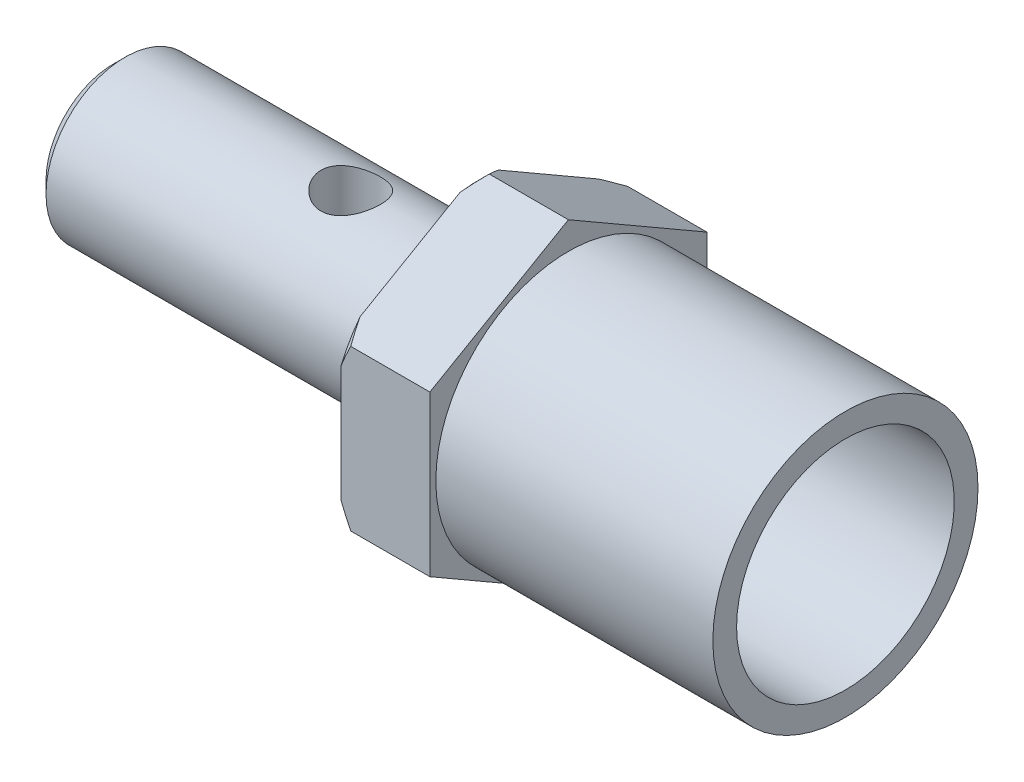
ISO-10303-21;
HEADER;
FILE_DESCRIPTION(('STEP AP214'),'2;1');
FILE_NAME('part.step','',(''),(''),'','','');
FILE_SCHEMA(('AUTOMOTIVE_DESIGN { 1 0 10303 214 1 1 1 1 }'));
ENDSEC;
DATA;
#1=APPLICATION_CONTEXT('core data for automotive mechanical design processes');
#2=APPLICATION_PROTOCOL_DEFINITION('international standard','automotive_design',2000,#1);
#3=PRODUCT_CONTEXT('',#1,'mechanical');
#4=PRODUCT('Part','Part','',(#3));
#5=PRODUCT_RELATED_PRODUCT_CATEGORY('part','',(#4));
#6=PRODUCT_DEFINITION_FORMATION('','',#4);
#7=PRODUCT_DEFINITION_CONTEXT('part definition',#1,'design');
#8=PRODUCT_DEFINITION('design','',#6,#7);
#9=PRODUCT_DEFINITION_SHAPE('','',#8);
#10=(LENGTH_UNIT() NAMED_UNIT(*) SI_UNIT(.MILLI.,.METRE.));
#11=(NAMED_UNIT(*) PLANE_ANGLE_UNIT() SI_UNIT($,.RADIAN.));
#12=(NAMED_UNIT(*) SI_UNIT($,.STERADIAN.) SOLID_ANGLE_UNIT());
#13=UNCERTAINTY_MEASURE_WITH_UNIT(LENGTH_MEASURE(1.E-05),#10,'distance_accuracy_value','');
#14=(GEOMETRIC_REPRESENTATION_CONTEXT(3) GLOBAL_UNCERTAINTY_ASSIGNED_CONTEXT((#13)) GLOBAL_UNIT_ASSIGNED_CONTEXT((#10,
#11,#12)) REPRESENTATION_CONTEXT('',''));
#15=CARTESIAN_POINT('',(0.,0.,0.));
#16=DIRECTION('',(0.,0.,1.));
#17=DIRECTION('',(1.,0.,0.));
#18=AXIS2_PLACEMENT_3D('',#15,#16,#17);
#19=CARTESIAN_POINT('',(1.2738755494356,2.,0.));
#20=DIRECTION('',(-1.,0.,0.));
#21=DIRECTION('',(0.,0.,1.));
#22=AXIS2_PLACEMENT_3D('',#19,#20,#21);
#23=PLANE('',#22);
#24=CARTESIAN_POINT('',(1.2738755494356,0.,0.));
#25=DIRECTION('',(-1.,0.,0.));
#26=DIRECTION('',(0.,0.,1.));
#27=AXIS2_PLACEMENT_3D('',#24,#25,#26);
#28=CIRCLE('',#27,2.);
#29=CARTESIAN_POINT('',(1.2738755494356,0.,2.));
#30=VERTEX_POINT('',#29);
#31=EDGE_CURVE('E691',#30,#30,#28,.T.);
#32=ORIENTED_EDGE('',*,*,#31,.F.);
#33=EDGE_LOOP('',(#32));
#34=FACE_BOUND('',#33,.T.);
#35=CARTESIAN_POINT('',(1.2738755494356,0.,0.));
#36=DIRECTION('',(-1.,0.,0.));
#37=DIRECTION('',(0.,0.,1.));
#38=AXIS2_PLACEMENT_3D('',#35,#36,#37);
#39=CIRCLE('',#38,2.79145188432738);
#40=CARTESIAN_POINT('',(1.2738755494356,0.,2.79145188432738));
#41=VERTEX_POINT('',#40);
#42=EDGE_CURVE('E831',#41,#41,#39,.T.);
#43=ORIENTED_EDGE('',*,*,#42,.T.);
#44=EDGE_LOOP('',(#43));
#45=FACE_BOUND('',#44,.T.);
#46=ADVANCED_FACE('F350',(#34,#45),#23,.T.);
#47=CARTESIAN_POINT('',(3.7738755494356,2.02072594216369,3.5));
#48=DIRECTION('',(0.,0.866025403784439,0.5));
#49=DIRECTION('',(0.,-0.5,0.866025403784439));
#50=AXIS2_PLACEMENT_3D('',#47,#48,#49);
#51=PLANE('',#50);
#52=DIRECTION('',(-1.,0.,0.));
#53=VECTOR('',#52,1.);
#54=CARTESIAN_POINT('',(3.7738755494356,4.04145188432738,0.));
#55=LINE('',#54,#53);
#56=CARTESIAN_POINT('',(3.7738755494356,4.04145188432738,0.));
#57=VERTEX_POINT('',#56);
#58=CARTESIAN_POINT('',(1.7738755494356,4.04145188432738,0.));
#59=VERTEX_POINT('',#58);
#60=EDGE_CURVE('E677',#57,#59,#55,.T.);
#61=ORIENTED_EDGE('',*,*,#60,.T.);
#62=CARTESIAN_POINT('',(1.77399102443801,4.04156735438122,-0.00020000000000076));
#63=CARTESIAN_POINT('',(1.75098997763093,4.01856712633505,0.0396375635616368));
#64=CARTESIAN_POINT('',(1.72845732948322,3.99544861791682,0.0796799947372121));
#65=CARTESIAN_POINT('',(1.68443878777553,3.94898048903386,0.160165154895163));
#66=CARTESIAN_POINT('',(1.66295229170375,3.92563101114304,0.200607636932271));
#67=CARTESIAN_POINT('',(1.62110770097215,3.87867817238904,0.281932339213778));
#68=CARTESIAN_POINT('',(1.60074967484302,3.85507479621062,0.322814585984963));
#69=CARTESIAN_POINT('',(1.56126089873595,3.80759686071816,0.405048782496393));
#70=CARTESIAN_POINT('',(1.54213087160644,3.78372215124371,0.44640099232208));
#71=CARTESIAN_POINT('',(1.5236755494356,3.75971619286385,0.487980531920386));
#72=B_SPLINE_CURVE_WITH_KNOTS('',3,(#62,#63,#64,#65,#66,#67,#68,#69,#70,#71),.UNSPECIFIED.,.F.,
.F.,(4,2,2,2,4),(0.,0.154291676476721,0.308493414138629,0.462704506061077,0.617005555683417),.UNSPECIFIED.);
#73=CARTESIAN_POINT('',(1.5238755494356,3.75997631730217,0.487529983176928));
#74=VERTEX_POINT('',#73);
#75=EDGE_CURVE('E515',#59,#74,#72,.T.);
#76=ORIENTED_EDGE('',*,*,#75,.T.);
#77=DIRECTION('',(0.,-0.5,0.866025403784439));
#78=VECTOR('',#77,1.);
#79=CARTESIAN_POINT('',(1.5238755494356,2.02072594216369,3.5));
#80=LINE('',#79,#78);
#81=CARTESIAN_POINT('',(1.5238755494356,2.30220150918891,3.01247001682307));
#82=VERTEX_POINT('',#81);
#83=EDGE_CURVE('E458',#74,#82,#80,.T.);
#84=ORIENTED_EDGE('',*,*,#83,.T.);
#85=CARTESIAN_POINT('',(1.5236755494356,2.30246163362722,3.01201946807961));
#86=CARTESIAN_POINT('',(1.54213087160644,2.27845567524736,3.05359900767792));
#87=CARTESIAN_POINT('',(1.56126089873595,2.25458096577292,3.09495121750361));
#88=CARTESIAN_POINT('',(1.60074967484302,2.20710303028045,3.17718541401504));
#89=CARTESIAN_POINT('',(1.62110770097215,2.18349965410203,3.21806766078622));
#90=CARTESIAN_POINT('',(1.66295229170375,2.13654681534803,3.29939236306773));
#91=CARTESIAN_POINT('',(1.68443878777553,2.11319733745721,3.33983484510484));
#92=CARTESIAN_POINT('',(1.72845732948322,2.06672920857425,3.42032000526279));
#93=CARTESIAN_POINT('',(1.75098997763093,2.04361070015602,3.46036243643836));
#94=CARTESIAN_POINT('',(1.77399102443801,2.02061047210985,3.5002));
#95=B_SPLINE_CURVE_WITH_KNOTS('',3,(#85,#86,#87,#88,#89,#90,#91,#92,#93,#94),.UNSPECIFIED.,.F.,
.F.,(4,2,2,2,4),(0.,0.154301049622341,0.30851214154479,0.462713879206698,0.617005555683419),.UNSPECIFIED.);
#96=CARTESIAN_POINT('',(1.7738755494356,2.02072594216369,3.5));
#97=VERTEX_POINT('',#96);
#98=EDGE_CURVE('E464',#82,#97,#95,.T.);
#99=ORIENTED_EDGE('',*,*,#98,.T.);
#100=DIRECTION('',(-1.,0.,0.));
#101=VECTOR('',#100,1.);
#102=CARTESIAN_POINT('',(3.7738755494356,2.02072594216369,3.5));
#103=LINE('',#102,#101);
#104=CARTESIAN_POINT('',(3.7738755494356,2.02072594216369,3.5));
#105=VERTEX_POINT('',#104);
#106=EDGE_CURVE('E379',#105,#97,#103,.T.);
#107=ORIENTED_EDGE('',*,*,#106,.F.);
#108=DIRECTION('',(0.,0.5,-0.866025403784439));
#109=VECTOR('',#108,1.);
#110=CARTESIAN_POINT('',(3.7738755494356,2.02072594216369,3.5));
#111=LINE('',#110,#109);
#112=EDGE_CURVE('E471',#105,#57,#111,.T.);
#113=ORIENTED_EDGE('',*,*,#112,.T.);
#114=EDGE_LOOP('',(#61,#76,#84,#99,#107,#113));
#115=FACE_BOUND('',#114,.T.);
#116=ADVANCED_FACE('F577',(#115),#51,.T.);
#117=CARTESIAN_POINT('',(3.7738755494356,-2.02072594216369,3.5));
#118=DIRECTION('',(0.,0.,1.));
#119=DIRECTION('',(0.,-1.,0.));
#120=AXIS2_PLACEMENT_3D('',#117,#118,#119);
#121=PLANE('',#120);
#122=DIRECTION('',(0.,-1.,0.));
#123=VECTOR('',#122,1.);
#124=CARTESIAN_POINT('',(1.5238755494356,-2.02072594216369,3.5));
#125=LINE('',#124,#123);
#126=CARTESIAN_POINT('',(1.5238755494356,1.45777480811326,3.5));
#127=VERTEX_POINT('',#126);
#128=CARTESIAN_POINT('',(1.5238755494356,-1.45777480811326,3.5));
#129=VERTEX_POINT('',#128);
#130=EDGE_CURVE('E447',#127,#129,#125,.T.);
#131=ORIENTED_EDGE('',*,*,#130,.T.);
#132=CARTESIAN_POINT('',(1.23370609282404,-0.0947556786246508,3.5));
#133=CARTESIAN_POINT('',(1.23518545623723,-0.149587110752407,3.5));
#134=CARTESIAN_POINT('',(1.23796039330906,-0.204374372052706,3.5));
#135=CARTESIAN_POINT('',(1.24603609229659,-0.313751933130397,3.5));
#136=CARTESIAN_POINT('',(1.25133635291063,-0.368342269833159,3.5));
#137=CARTESIAN_POINT('',(1.27090609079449,-0.531497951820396,3.5));
#138=CARTESIAN_POINT('',(1.28885014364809,-0.639639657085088,3.5));
#139=CARTESIAN_POINT('',(1.33334551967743,-0.852887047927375,3.5));
#140=CARTESIAN_POINT('',(1.35980316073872,-0.958012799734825,3.5));
#141=CARTESIAN_POINT('',(1.42021694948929,-1.1660758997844,3.5));
#142=CARTESIAN_POINT('',(1.45417312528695,-1.26901323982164,3.5));
#143=CARTESIAN_POINT('',(1.50228261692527,-1.40093758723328,3.5));
#144=CARTESIAN_POINT('',(1.51356150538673,-1.43100265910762,3.5));
#145=CARTESIAN_POINT('',(1.53665773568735,-1.49096021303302,3.5));
#146=CARTESIAN_POINT('',(1.54847560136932,-1.52085249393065,3.5));
#147=CARTESIAN_POINT('',(1.61241299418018,-1.67869995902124,3.5));
#148=CARTESIAN_POINT('',(1.66889644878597,-1.8049068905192,3.5));
#149=CARTESIAN_POINT('',(1.78907870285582,-2.05386135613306,3.5));
#150=CARTESIAN_POINT('',(1.85278160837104,-2.17660687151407,3.5));
#151=CARTESIAN_POINT('',(1.98601825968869,-2.41937846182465,3.5));
#152=CARTESIAN_POINT('',(2.05556979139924,-2.53939471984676,3.5));
#153=CARTESIAN_POINT('',(2.1990952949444,-2.77670311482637,3.5));
#154=CARTESIAN_POINT('',(2.27306841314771,-2.89399577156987,3.5));
#155=CARTESIAN_POINT('',(2.42349349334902,-3.12468810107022,3.5));
#156=CARTESIAN_POINT('',(2.49989764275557,-3.23811908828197,3.5));
#157=CARTESIAN_POINT('',(2.65546534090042,-3.46308182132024,3.5));
#158=CARTESIAN_POINT('',(2.73462914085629,-3.57461339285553,3.5));
#159=CARTESIAN_POINT('',(2.89456727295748,-3.79518934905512,3.5));
#160=CARTESIAN_POINT('',(2.97532428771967,-3.90424633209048,3.5));
#161=CARTESIAN_POINT('',(3.13864647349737,-4.12095334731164,3.5));
#162=CARTESIAN_POINT('',(3.22121115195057,-4.22860375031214,3.5));
#163=CARTESIAN_POINT('',(3.3045054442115,-4.33567703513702,3.5));
#164=B_SPLINE_CURVE_WITH_KNOTS('',3,(#132,#133,#134,#135,#136,#137,#138,#139,#140,#141,#142,
#143,#144,#145,#146,#147,#148,#149,#150,#151,#152,#153,#154,#155,#156,#157,#158,#159,#160,#161,
#162,#163),.UNSPECIFIED.,.F.,.F.,(4,2,2,2,2,2,2,2,2,2,2,2,2,2,2,4),(0.,0.164522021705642,
0.329011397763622,0.657417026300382,0.982325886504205,1.30723596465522,1.40356701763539,
1.49999377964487,1.91446249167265,2.32916812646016,2.74518396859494,3.16111975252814,
3.57136013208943,3.98163795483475,4.38872442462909,4.79570131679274),.UNSPECIFIED.);
#165=CARTESIAN_POINT('',(1.7738755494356,-2.02072594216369,3.5));
#166=VERTEX_POINT('',#165);
#167=EDGE_CURVE('E469',#129,#166,#164,.T.);
#168=ORIENTED_EDGE('',*,*,#167,.T.);
#169=DIRECTION('',(-1.,0.,0.));
#170=VECTOR('',#169,1.);
#171=CARTESIAN_POINT('',(3.7738755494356,-2.02072594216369,3.5));
#172=LINE('',#171,#170);
#173=CARTESIAN_POINT('',(3.7738755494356,-2.02072594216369,3.5));
#174=VERTEX_POINT('',#173);
#175=EDGE_CURVE('E859',#174,#166,#172,.T.);
#176=ORIENTED_EDGE('',*,*,#175,.F.);
#177=DIRECTION('',(0.,1.,0.));
#178=VECTOR('',#177,1.);
#179=CARTESIAN_POINT('',(3.7738755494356,-2.02072594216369,3.5));
#180=LINE('',#179,#178);
#181=EDGE_CURVE('E681',#174,#105,#180,.T.);
#182=ORIENTED_EDGE('',*,*,#181,.T.);
#183=ORIENTED_EDGE('',*,*,#106,.T.);
#184=CARTESIAN_POINT('',(3.30450544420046,4.33567703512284,3.5));
#185=CARTESIAN_POINT('',(3.21886791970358,4.22558900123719,3.5));
#186=CARTESIAN_POINT('',(3.13399963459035,4.11489173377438,3.5));
#187=CARTESIAN_POINT('',(2.96618236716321,3.8920017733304,3.5));
#188=CARTESIAN_POINT('',(2.88323396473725,3.77980864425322,3.5));
#189=CARTESIAN_POINT('',(2.71905914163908,3.55284483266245,3.5));
#190=CARTESIAN_POINT('',(2.63785090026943,3.43806095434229,3.5));
#191=CARTESIAN_POINT('',(2.47840269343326,3.20645880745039,3.5));
#192=CARTESIAN_POINT('',(2.40016243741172,3.08964073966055,3.5));
#193=CARTESIAN_POINT('',(2.25053066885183,2.85844940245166,3.5));
#194=CARTESIAN_POINT('',(2.17898982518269,2.74417318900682,3.5));
#195=CARTESIAN_POINT('',(2.04019403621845,2.51305118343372,3.5));
#196=CARTESIAN_POINT('',(1.97293855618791,2.39620571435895,3.5));
#197=CARTESIAN_POINT('',(1.84400687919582,2.15983893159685,3.5));
#198=CARTESIAN_POINT('',(1.78231695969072,2.0403251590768,3.5));
#199=CARTESIAN_POINT('',(1.6658167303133,1.79801577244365,3.5));
#200=CARTESIAN_POINT('',(1.61100354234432,1.67522155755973,3.5));
#201=CARTESIAN_POINT('',(1.51403714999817,1.43583034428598,3.5));
#202=CARTESIAN_POINT('',(1.47122845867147,1.3195017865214,3.5));
#203=CARTESIAN_POINT('',(1.39473466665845,1.08393638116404,3.5));
#204=CARTESIAN_POINT('',(1.36104315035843,0.964701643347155,3.5));
#205=CARTESIAN_POINT('',(1.3040300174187,0.721493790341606,3.5));
#206=CARTESIAN_POINT('',(1.28090075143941,0.597474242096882,3.5));
#207=CARTESIAN_POINT('',(1.25580491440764,0.409976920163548,3.5));
#208=CARTESIAN_POINT('',(1.24903585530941,0.347119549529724,3.5));
#209=CARTESIAN_POINT('',(1.23883710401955,0.221113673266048,3.5));
#210=CARTESIAN_POINT('',(1.23540855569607,0.15796507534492,3.5));
#211=CARTESIAN_POINT('',(1.23370609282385,0.0947556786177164,3.5));
#212=B_SPLINE_CURVE_WITH_KNOTS('',3,(#184,#185,#186,#187,#188,#189,#190,#191,#192,#193,#194,
#195,#196,#197,#198,#199,#200,#201,#202,#203,#204,#205,#206,#207,#208,#209,#210,#211),
.UNSPECIFIED.,.F.,.F.,(4,2,2,2,2,2,2,2,2,2,2,2,2,4),(0.,0.418433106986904,0.836990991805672,
1.25877205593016,1.68051172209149,2.08490570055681,2.48924911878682,2.89256665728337,
3.29571482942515,3.66727038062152,4.03856379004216,4.41637281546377,4.6059558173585,
4.79560371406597),.UNSPECIFIED.);
#213=EDGE_CURVE('E463',#97,#127,#212,.T.);
#214=ORIENTED_EDGE('',*,*,#213,.T.);
#215=EDGE_LOOP('',(#131,#168,#176,#182,#183,#214));
#216=FACE_BOUND('',#215,.T.);
#217=ADVANCED_FACE('F467',(#216),#121,.T.);
#218=CARTESIAN_POINT('',(3.7738755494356,-4.04145188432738,0.));
#219=DIRECTION('',(0.,-0.866025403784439,0.5));
#220=DIRECTION('',(0.,-0.5,-0.866025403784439));
#221=AXIS2_PLACEMENT_3D('',#218,#219,#220);
#222=PLANE('',#221);
#223=ORIENTED_EDGE('',*,*,#175,.T.);
#224=CARTESIAN_POINT('',(1.77399102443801,-2.02061047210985,3.5002));
#225=CARTESIAN_POINT('',(1.75098997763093,-2.04361070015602,3.46036243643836));
#226=CARTESIAN_POINT('',(1.72845732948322,-2.06672920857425,3.42032000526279));
#227=CARTESIAN_POINT('',(1.68443878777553,-2.11319733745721,3.33983484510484));
#228=CARTESIAN_POINT('',(1.66295229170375,-2.13654681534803,3.29939236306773));
#229=CARTESIAN_POINT('',(1.62110770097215,-2.18349965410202,3.21806766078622));
#230=CARTESIAN_POINT('',(1.60074967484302,-2.20710303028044,3.17718541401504));
#231=CARTESIAN_POINT('',(1.56126089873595,-2.25458096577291,3.09495121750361));
#232=CARTESIAN_POINT('',(1.54213087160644,-2.27845567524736,3.05359900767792));
#233=CARTESIAN_POINT('',(1.5236755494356,-2.30246163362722,3.01201946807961));
#234=B_SPLINE_CURVE_WITH_KNOTS('',3,(#224,#225,#226,#227,#228,#229,#230,#231,#232,#233),
.UNSPECIFIED.,.F.,.F.,(4,2,2,2,4),(0.,0.154291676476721,0.308493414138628,0.462704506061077,
0.617005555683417),.UNSPECIFIED.);
#235=CARTESIAN_POINT('',(1.5238755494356,-2.3022015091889,3.01247001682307));
#236=VERTEX_POINT('',#235);
#237=EDGE_CURVE('E473',#166,#236,#234,.T.);
#238=ORIENTED_EDGE('',*,*,#237,.T.);
#239=DIRECTION('',(0.,-0.5,-0.866025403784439));
#240=VECTOR('',#239,1.);
#241=CARTESIAN_POINT('',(1.5238755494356,-4.04145188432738,0.));
#242=LINE('',#241,#240);
#243=CARTESIAN_POINT('',(1.5238755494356,-3.75997631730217,0.487529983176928));
#244=VERTEX_POINT('',#243);
#245=EDGE_CURVE('E459',#236,#244,#242,.T.);
#246=ORIENTED_EDGE('',*,*,#245,.T.);
#247=CARTESIAN_POINT('',(1.5236755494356,-3.75971619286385,0.487980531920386));
#248=CARTESIAN_POINT('',(1.54213087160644,-3.78372215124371,0.44640099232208));
#249=CARTESIAN_POINT('',(1.56126089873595,-3.80759686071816,0.405048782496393));
#250=CARTESIAN_POINT('',(1.60074967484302,-3.85507479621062,0.322814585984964));
#251=CARTESIAN_POINT('',(1.62110770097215,-3.87867817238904,0.281932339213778));
#252=CARTESIAN_POINT('',(1.66295229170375,-3.92563101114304,0.200607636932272));
#253=CARTESIAN_POINT('',(1.68443878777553,-3.94898048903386,0.160165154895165));
#254=CARTESIAN_POINT('',(1.72845732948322,-3.99544861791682,0.0796799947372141));
#255=CARTESIAN_POINT('',(1.75098997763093,-4.01856712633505,0.0396375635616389));
#256=CARTESIAN_POINT('',(1.77399102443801,-4.04156735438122,-0.000199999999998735));
#257=B_SPLINE_CURVE_WITH_KNOTS('',3,(#247,#248,#249,#250,#251,#252,#253,#254,#255,#256),
.UNSPECIFIED.,.F.,.F.,(4,2,2,2,4),(0.,0.15430104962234,0.308512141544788,0.462713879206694,
0.617005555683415),.UNSPECIFIED.);
#258=CARTESIAN_POINT('',(1.7738755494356,-4.04145188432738,0.));
#259=VERTEX_POINT('',#258);
#260=EDGE_CURVE('E548',#244,#259,#257,.T.);
#261=ORIENTED_EDGE('',*,*,#260,.T.);
#262=DIRECTION('',(-1.,0.,0.));
#263=VECTOR('',#262,1.);
#264=CARTESIAN_POINT('',(3.7738755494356,-4.04145188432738,0.));
#265=LINE('',#264,#263);
#266=CARTESIAN_POINT('',(3.7738755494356,-4.04145188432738,0.));
#267=VERTEX_POINT('',#266);
#268=EDGE_CURVE('E852',#267,#259,#265,.T.);
#269=ORIENTED_EDGE('',*,*,#268,.F.);
#270=DIRECTION('',(0.,0.5,0.866025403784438));
#271=VECTOR('',#270,1.);
#272=CARTESIAN_POINT('',(3.7738755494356,-4.04145188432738,0.));
#273=LINE('',#272,#271);
#274=EDGE_CURVE('E685',#267,#174,#273,.T.);
#275=ORIENTED_EDGE('',*,*,#274,.T.);
#276=EDGE_LOOP('',(#223,#238,#246,#261,#269,#275));
#277=FACE_BOUND('',#276,.T.);
#278=ADVANCED_FACE('F557',(#277),#222,.T.);
#279=CARTESIAN_POINT('',(3.7738755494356,-2.02072594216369,-3.5));
#280=DIRECTION('',(0.,-0.866025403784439,-0.5));
#281=DIRECTION('',(0.,0.5,-0.866025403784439));
#282=AXIS2_PLACEMENT_3D('',#279,#280,#281);
#283=PLANE('',#282);
#284=ORIENTED_EDGE('',*,*,#268,.T.);
#285=CARTESIAN_POINT('',(1.77399102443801,-4.04156735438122,0.000200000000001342));
#286=CARTESIAN_POINT('',(1.75098997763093,-4.01856712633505,-0.0396375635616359));
#287=CARTESIAN_POINT('',(1.72845732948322,-3.99544861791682,-0.079679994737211));
#288=CARTESIAN_POINT('',(1.68443878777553,-3.94898048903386,-0.160165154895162));
#289=CARTESIAN_POINT('',(1.66295229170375,-3.92563101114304,-0.200607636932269));
#290=CARTESIAN_POINT('',(1.62110770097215,-3.87867817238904,-0.281932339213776));
#291=CARTESIAN_POINT('',(1.60074967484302,-3.85507479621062,-0.322814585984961));
#292=CARTESIAN_POINT('',(1.56126089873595,-3.80759686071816,-0.40504878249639));
#293=CARTESIAN_POINT('',(1.54213087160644,-3.78372215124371,-0.446400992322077));
#294=CARTESIAN_POINT('',(1.5236755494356,-3.75971619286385,-0.487980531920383));
#295=B_SPLINE_CURVE_WITH_KNOTS('',3,(#285,#286,#287,#288,#289,#290,#291,#292,#293,#294),
.UNSPECIFIED.,.F.,.F.,(4,2,2,2,4),(0.,0.154291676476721,0.308493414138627,0.462704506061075,
0.617005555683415),.UNSPECIFIED.);
#296=CARTESIAN_POINT('',(1.5238755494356,-3.75997631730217,-0.487529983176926));
#297=VERTEX_POINT('',#296);
#298=EDGE_CURVE('E542',#259,#297,#295,.T.);
#299=ORIENTED_EDGE('',*,*,#298,.T.);
#300=DIRECTION('',(0.,0.5,-0.866025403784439));
#301=VECTOR('',#300,1.);
#302=CARTESIAN_POINT('',(1.5238755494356,-2.02072594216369,-3.5));
#303=LINE('',#302,#301);
#304=CARTESIAN_POINT('',(1.5238755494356,-2.3022015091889,-3.01247001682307));
#305=VERTEX_POINT('',#304);
#306=EDGE_CURVE('E839',#297,#305,#303,.T.);
#307=ORIENTED_EDGE('',*,*,#306,.T.);
#308=CARTESIAN_POINT('',(1.5236755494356,-2.30246163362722,-3.01201946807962));
#309=CARTESIAN_POINT('',(1.54213087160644,-2.27845567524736,-3.05359900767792));
#310=CARTESIAN_POINT('',(1.56126089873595,-2.25458096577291,-3.09495121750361));
#311=CARTESIAN_POINT('',(1.60074967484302,-2.20710303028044,-3.17718541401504));
#312=CARTESIAN_POINT('',(1.62110770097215,-2.18349965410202,-3.21806766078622));
#313=CARTESIAN_POINT('',(1.66295229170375,-2.13654681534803,-3.29939236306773));
#314=CARTESIAN_POINT('',(1.68443878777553,-2.11319733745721,-3.33983484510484));
#315=CARTESIAN_POINT('',(1.72845732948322,-2.06672920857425,-3.42032000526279));
#316=CARTESIAN_POINT('',(1.75098997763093,-2.04361070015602,-3.46036243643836));
#317=CARTESIAN_POINT('',(1.77399102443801,-2.02061047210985,-3.5002));
#318=B_SPLINE_CURVE_WITH_KNOTS('',3,(#308,#309,#310,#311,#312,#313,#314,#315,#316,#317),
.UNSPECIFIED.,.F.,.F.,(4,2,2,2,4),(0.,0.15430104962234,0.308512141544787,0.462713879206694,
0.617005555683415),.UNSPECIFIED.);
#319=CARTESIAN_POINT('',(1.7738755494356,-2.02072594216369,-3.5));
#320=VERTEX_POINT('',#319);
#321=EDGE_CURVE('E535',#305,#320,#318,.T.);
#322=ORIENTED_EDGE('',*,*,#321,.T.);
#323=DIRECTION('',(-1.,0.,0.));
#324=VECTOR('',#323,1.);
#325=CARTESIAN_POINT('',(3.7738755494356,-2.02072594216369,-3.5));
#326=LINE('',#325,#324);
#327=CARTESIAN_POINT('',(3.7738755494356,-2.02072594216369,-3.5));
#328=VERTEX_POINT('',#327);
#329=EDGE_CURVE('E683',#328,#320,#326,.T.);
#330=ORIENTED_EDGE('',*,*,#329,.F.);
#331=DIRECTION('',(0.,-0.5,0.866025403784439));
#332=VECTOR('',#331,1.);
#333=CARTESIAN_POINT('',(3.7738755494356,-2.02072594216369,-3.5));
#334=LINE('',#333,#332);
#335=EDGE_CURVE('E858',#328,#267,#334,.T.);
#336=ORIENTED_EDGE('',*,*,#335,.T.);
#337=EDGE_LOOP('',(#284,#299,#307,#322,#330,#336));
#338=FACE_BOUND('',#337,.T.);
#339=ADVANCED_FACE('F560',(#338),#283,.T.);
#340=CARTESIAN_POINT('',(3.7738755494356,2.02072594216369,-3.5));
#341=DIRECTION('',(0.,0.,-1.));
#342=DIRECTION('',(0.,1.,0.));
#343=AXIS2_PLACEMENT_3D('',#340,#341,#342);
#344=PLANE('',#343);
#345=ORIENTED_EDGE('',*,*,#329,.T.);
#346=CARTESIAN_POINT('',(3.30450544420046,-4.33567703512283,-3.5));
#347=CARTESIAN_POINT('',(3.21886791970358,-4.22558900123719,-3.5));
#348=CARTESIAN_POINT('',(3.13399963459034,-4.11489173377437,-3.5));
#349=CARTESIAN_POINT('',(2.9661823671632,-3.89200177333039,-3.5));
#350=CARTESIAN_POINT('',(2.88323396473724,-3.77980864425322,-3.5));
#351=CARTESIAN_POINT('',(2.71905914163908,-3.55284483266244,-3.5));
#352=CARTESIAN_POINT('',(2.63785090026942,-3.43806095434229,-3.5));
#353=CARTESIAN_POINT('',(2.47840269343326,-3.20645880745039,-3.5));
#354=CARTESIAN_POINT('',(2.40016243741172,-3.08964073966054,-3.5));
#355=CARTESIAN_POINT('',(2.25053066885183,-2.85844940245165,-3.5));
#356=CARTESIAN_POINT('',(2.17898982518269,-2.74417318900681,-3.5));
#357=CARTESIAN_POINT('',(2.04019403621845,-2.51305118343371,-3.5));
#358=CARTESIAN_POINT('',(1.97293855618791,-2.39620571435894,-3.5));
#359=CARTESIAN_POINT('',(1.84400687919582,-2.15983893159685,-3.5));
#360=CARTESIAN_POINT('',(1.78231695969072,-2.0403251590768,-3.5));
#361=CARTESIAN_POINT('',(1.6658167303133,-1.79801577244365,-3.5));
#362=CARTESIAN_POINT('',(1.61100354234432,-1.67522155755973,-3.5));
#363=CARTESIAN_POINT('',(1.51403714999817,-1.43583034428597,-3.5));
#364=CARTESIAN_POINT('',(1.47122845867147,-1.3195017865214,-3.5));
#365=CARTESIAN_POINT('',(1.39473466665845,-1.08393638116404,-3.5));
#366=CARTESIAN_POINT('',(1.36104315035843,-0.964701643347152,-3.5));
#367=CARTESIAN_POINT('',(1.3040300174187,-0.721493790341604,-3.5));
#368=CARTESIAN_POINT('',(1.28090075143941,-0.59747424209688,-3.5));
#369=CARTESIAN_POINT('',(1.25580491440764,-0.409976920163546,-3.5));
#370=CARTESIAN_POINT('',(1.24903585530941,-0.347119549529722,-3.5));
#371=CARTESIAN_POINT('',(1.23883710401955,-0.221113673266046,-3.5));
#372=CARTESIAN_POINT('',(1.23540855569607,-0.157965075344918,-3.5));
#373=CARTESIAN_POINT('',(1.23370609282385,-0.0947556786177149,-3.5));
#374=B_SPLINE_CURVE_WITH_KNOTS('',3,(#346,#347,#348,#349,#350,#351,#352,#353,#354,#355,#356,
#357,#358,#359,#360,#361,#362,#363,#364,#365,#366,#367,#368,#369,#370,#371,#372,#373),
.UNSPECIFIED.,.F.,.F.,(4,2,2,2,2,2,2,2,2,2,2,2,2,4),(0.,0.418433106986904,0.83699099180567,
1.25877205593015,1.68051172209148,2.08490570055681,2.48924911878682,2.89256665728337,
3.29571482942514,3.66727038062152,4.03856379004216,4.41637281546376,4.60595581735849,
4.79560371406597),.UNSPECIFIED.);
#375=CARTESIAN_POINT('',(1.5238755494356,-1.45777480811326,-3.5));
#376=VERTEX_POINT('',#375);
#377=EDGE_CURVE('E529',#320,#376,#374,.T.);
#378=ORIENTED_EDGE('',*,*,#377,.T.);
#379=DIRECTION('',(0.,1.,0.));
#380=VECTOR('',#379,1.);
#381=CARTESIAN_POINT('',(1.5238755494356,2.02072594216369,-3.5));
#382=LINE('',#381,#380);
#383=CARTESIAN_POINT('',(1.5238755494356,1.45777480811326,-3.5));
#384=VERTEX_POINT('',#383);
#385=EDGE_CURVE('E465',#376,#384,#382,.T.);
#386=ORIENTED_EDGE('',*,*,#385,.T.);
#387=CARTESIAN_POINT('',(1.23370609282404,0.0947556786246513,-3.5));
#388=CARTESIAN_POINT('',(1.23518545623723,0.149587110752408,-3.5));
#389=CARTESIAN_POINT('',(1.23796039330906,0.204374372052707,-3.5));
#390=CARTESIAN_POINT('',(1.24603609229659,0.313751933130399,-3.5));
#391=CARTESIAN_POINT('',(1.25133635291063,0.368342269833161,-3.5));
#392=CARTESIAN_POINT('',(1.27090609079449,0.531497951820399,-3.5));
#393=CARTESIAN_POINT('',(1.28885014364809,0.639639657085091,-3.5));
#394=CARTESIAN_POINT('',(1.33334551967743,0.852887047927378,-3.5));
#395=CARTESIAN_POINT('',(1.35980316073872,0.958012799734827,-3.5));
#396=CARTESIAN_POINT('',(1.42021694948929,1.1660758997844,-3.5));
#397=CARTESIAN_POINT('',(1.45417312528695,1.26901323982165,-3.5));
#398=CARTESIAN_POINT('',(1.50228261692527,1.40093758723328,-3.5));
#399=CARTESIAN_POINT('',(1.51356150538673,1.43100265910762,-3.5));
#400=CARTESIAN_POINT('',(1.53665773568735,1.49096021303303,-3.5));
#401=CARTESIAN_POINT('',(1.54847560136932,1.52085249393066,-3.5));
#402=CARTESIAN_POINT('',(1.61241299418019,1.67869995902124,-3.5));
#403=CARTESIAN_POINT('',(1.66889644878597,1.8049068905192,-3.5));
#404=CARTESIAN_POINT('',(1.78907870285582,2.05386135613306,-3.5));
#405=CARTESIAN_POINT('',(1.85278160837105,2.17660687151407,-3.5));
#406=CARTESIAN_POINT('',(1.98601825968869,2.41937846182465,-3.5));
#407=CARTESIAN_POINT('',(2.05556979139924,2.53939471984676,-3.5));
#408=CARTESIAN_POINT('',(2.1990952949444,2.77670311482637,-3.5));
#409=CARTESIAN_POINT('',(2.27306841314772,2.89399577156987,-3.5));
#410=CARTESIAN_POINT('',(2.42349349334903,3.12468810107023,-3.5));
#411=CARTESIAN_POINT('',(2.49989764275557,3.23811908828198,-3.5));
#412=CARTESIAN_POINT('',(2.65546534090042,3.46308182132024,-3.5));
#413=CARTESIAN_POINT('',(2.73462914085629,3.57461339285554,-3.5));
#414=CARTESIAN_POINT('',(2.89456727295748,3.79518934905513,-3.5));
#415=CARTESIAN_POINT('',(2.97532428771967,3.90424633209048,-3.5));
#416=CARTESIAN_POINT('',(3.13864647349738,4.12095334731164,-3.5));
#417=CARTESIAN_POINT('',(3.22121115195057,4.22860375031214,-3.5));
#418=CARTESIAN_POINT('',(3.3045054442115,4.33567703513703,-3.5));
#419=B_SPLINE_CURVE_WITH_KNOTS('',3,(#387,#388,#389,#390,#391,#392,#393,#394,#395,#396,#397,
#398,#399,#400,#401,#402,#403,#404,#405,#406,#407,#408,#409,#410,#411,#412,#413,#414,#415,#416,
#417,#418),.UNSPECIFIED.,.F.,.F.,(4,2,2,2,2,2,2,2,2,2,2,2,2,2,2,4),(0.,0.164522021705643,
0.329011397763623,0.657417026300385,0.982325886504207,1.30723596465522,1.40356701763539,
1.49999377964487,1.91446249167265,2.32916812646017,2.74518396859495,3.16111975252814,
3.57136013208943,3.98163795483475,4.38872442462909,4.79570131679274),.UNSPECIFIED.);
#420=CARTESIAN_POINT('',(1.7738755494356,2.02072594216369,-3.5));
#421=VERTEX_POINT('',#420);
#422=EDGE_CURVE('E522',#384,#421,#419,.T.);
#423=ORIENTED_EDGE('',*,*,#422,.T.);
#424=DIRECTION('',(-1.,0.,0.));
#425=VECTOR('',#424,1.);
#426=CARTESIAN_POINT('',(3.7738755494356,2.02072594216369,-3.5));
#427=LINE('',#426,#425);
#428=CARTESIAN_POINT('',(3.7738755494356,2.02072594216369,-3.5));
#429=VERTEX_POINT('',#428);
#430=EDGE_CURVE('E680',#429,#421,#427,.T.);
#431=ORIENTED_EDGE('',*,*,#430,.F.);
#432=DIRECTION('',(0.,-1.,0.));
#433=VECTOR('',#432,1.);
#434=CARTESIAN_POINT('',(3.7738755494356,2.02072594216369,-3.5));
#435=LINE('',#434,#433);
#436=EDGE_CURVE('E866',#429,#328,#435,.T.);
#437=ORIENTED_EDGE('',*,*,#436,.T.);
#438=EDGE_LOOP('',(#345,#378,#386,#423,#431,#437));
#439=FACE_BOUND('',#438,.T.);
#440=ADVANCED_FACE('F565',(#439),#344,.T.);
#441=CARTESIAN_POINT('',(3.7738755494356,4.04145188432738,0.));
#442=DIRECTION('',(0.,0.866025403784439,-0.5));
#443=DIRECTION('',(0.,0.5,0.866025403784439));
#444=AXIS2_PLACEMENT_3D('',#441,#442,#443);
#445=PLANE('',#444);
#446=ORIENTED_EDGE('',*,*,#430,.T.);
#447=CARTESIAN_POINT('',(1.77399102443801,2.02061047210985,-3.5002));
#448=CARTESIAN_POINT('',(1.75098997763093,2.04361070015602,-3.46036243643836));
#449=CARTESIAN_POINT('',(1.72845732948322,2.06672920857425,-3.42032000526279));
#450=CARTESIAN_POINT('',(1.68443878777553,2.11319733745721,-3.33983484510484));
#451=CARTESIAN_POINT('',(1.66295229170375,2.13654681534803,-3.29939236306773));
#452=CARTESIAN_POINT('',(1.62110770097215,2.18349965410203,-3.21806766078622));
#453=CARTESIAN_POINT('',(1.60074967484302,2.20710303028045,-3.17718541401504));
#454=CARTESIAN_POINT('',(1.56126089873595,2.25458096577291,-3.09495121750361));
#455=CARTESIAN_POINT('',(1.54213087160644,2.27845567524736,-3.05359900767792));
#456=CARTESIAN_POINT('',(1.5236755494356,2.30246163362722,-3.01201946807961));
#457=B_SPLINE_CURVE_WITH_KNOTS('',3,(#447,#448,#449,#450,#451,#452,#453,#454,#455,#456),
.UNSPECIFIED.,.F.,.F.,(4,2,2,2,4),(0.,0.154291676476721,0.308493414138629,0.462704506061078,
0.617005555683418),.UNSPECIFIED.);
#458=CARTESIAN_POINT('',(1.5238755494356,2.3022015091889,-3.01247001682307));
#459=VERTEX_POINT('',#458);
#460=EDGE_CURVE('E11',#421,#459,#457,.T.);
#461=ORIENTED_EDGE('',*,*,#460,.T.);
#462=DIRECTION('',(0.,0.5,0.866025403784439));
#463=VECTOR('',#462,1.);
#464=CARTESIAN_POINT('',(1.5238755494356,4.04145188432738,0.));
#465=LINE('',#464,#463);
#466=CARTESIAN_POINT('',(1.5238755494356,3.75997631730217,-0.487529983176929));
#467=VERTEX_POINT('',#466);
#468=EDGE_CURVE('E668',#459,#467,#465,.T.);
#469=ORIENTED_EDGE('',*,*,#468,.T.);
#470=CARTESIAN_POINT('',(1.5236755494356,3.75971619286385,-0.487980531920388));
#471=CARTESIAN_POINT('',(1.54213087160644,3.78372215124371,-0.446400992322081));
#472=CARTESIAN_POINT('',(1.56126089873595,3.80759686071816,-0.405048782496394));
#473=CARTESIAN_POINT('',(1.60074967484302,3.85507479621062,-0.322814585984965));
#474=CARTESIAN_POINT('',(1.62110770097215,3.87867817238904,-0.281932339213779));
#475=CARTESIAN_POINT('',(1.66295229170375,3.92563101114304,-0.200607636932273));
#476=CARTESIAN_POINT('',(1.68443878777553,3.94898048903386,-0.160165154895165));
#477=CARTESIAN_POINT('',(1.72845732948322,3.99544861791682,-0.0796799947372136));
#478=CARTESIAN_POINT('',(1.75098997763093,4.01856712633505,-0.0396375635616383));
#479=CARTESIAN_POINT('',(1.77399102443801,4.04156735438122,0.000199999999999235));
#480=B_SPLINE_CURVE_WITH_KNOTS('',3,(#470,#471,#472,#473,#474,#475,#476,#477,#478,#479),
.UNSPECIFIED.,.F.,.F.,(4,2,2,2,4),(0.,0.154301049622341,0.308512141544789,0.462713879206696,
0.617005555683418),.UNSPECIFIED.);
#481=EDGE_CURVE('E363',#467,#59,#480,.T.);
#482=ORIENTED_EDGE('',*,*,#481,.T.);
#483=ORIENTED_EDGE('',*,*,#60,.F.);
#484=DIRECTION('',(0.,-0.5,-0.866025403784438));
#485=VECTOR('',#484,1.);
#486=CARTESIAN_POINT('',(3.7738755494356,4.04145188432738,0.));
#487=LINE('',#486,#485);
#488=EDGE_CURVE('E869',#57,#429,#487,.T.);
#489=ORIENTED_EDGE('',*,*,#488,.T.);
#490=EDGE_LOOP('',(#446,#461,#469,#482,#483,#489));
#491=FACE_BOUND('',#490,.T.);
#492=ADVANCED_FACE('F570',(#491),#445,.T.);
#493=CARTESIAN_POINT('',(10.773875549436,0.,0.));
#494=DIRECTION('',(-1.,0.,0.));
#495=DIRECTION('',(0.,0.,1.));
#496=AXIS2_PLACEMENT_3D('',#493,#494,#495);
#497=CYLINDRICAL_SURFACE('',#496,3.35);
#498=CARTESIAN_POINT('',(10.773875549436,0.,0.));
#499=DIRECTION('',(-1.,0.,0.));
#500=DIRECTION('',(0.,0.,1.));
#501=AXIS2_PLACEMENT_3D('',#498,#499,#500);
#502=CIRCLE('',#501,3.35);
#503=CARTESIAN_POINT('',(10.773875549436,0.,3.35));
#504=VERTEX_POINT('',#503);
#505=EDGE_CURVE('E671',#504,#504,#502,.T.);
#506=ORIENTED_EDGE('',*,*,#505,.T.);
#507=EDGE_LOOP('',(#506));
#508=FACE_BOUND('',#507,.T.);
#509=CARTESIAN_POINT('',(3.7738755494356,0.,0.));
#510=DIRECTION('',(-1.,0.,0.));
#511=DIRECTION('',(0.,0.,1.));
#512=AXIS2_PLACEMENT_3D('',#509,#510,#511);
#513=CIRCLE('',#512,3.35);
#514=CARTESIAN_POINT('',(3.7738755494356,0.,3.35));
#515=VERTEX_POINT('',#514);
#516=EDGE_CURVE('E669',#515,#515,#513,.F.);
#517=ORIENTED_EDGE('',*,*,#516,.T.);
#518=EDGE_LOOP('',(#517));
#519=FACE_BOUND('',#518,.T.);
#520=ADVANCED_FACE('F575',(#508,#519),#497,.T.);
#521=CARTESIAN_POINT('',(10.773875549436,3.35,0.));
#522=DIRECTION('',(1.,0.,0.));
#523=DIRECTION('',(0.,0.,-1.));
#524=AXIS2_PLACEMENT_3D('',#521,#522,#523);
#525=PLANE('',#524);
#526=CARTESIAN_POINT('',(10.773875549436,0.,0.));
#527=DIRECTION('',(-1.,0.,0.));
#528=DIRECTION('',(0.,0.,1.));
#529=AXIS2_PLACEMENT_3D('',#526,#527,#528);
#530=CIRCLE('',#529,2.75);
#531=CARTESIAN_POINT('',(10.773875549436,0.,2.75));
#532=VERTEX_POINT('',#531);
#533=EDGE_CURVE('E656',#532,#532,#530,.T.);
#534=ORIENTED_EDGE('',*,*,#533,.T.);
#535=EDGE_LOOP('',(#534));
#536=FACE_BOUND('',#535,.T.);
#537=ORIENTED_EDGE('',*,*,#505,.F.);
#538=EDGE_LOOP('',(#537));
#539=FACE_BOUND('',#538,.T.);
#540=ADVANCED_FACE('F352',(#536,#539),#525,.T.);
#541=CARTESIAN_POINT('',(10.773875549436,0.,0.));
#542=DIRECTION('',(-1.,0.,0.));
#543=DIRECTION('',(0.,0.,1.));
#544=AXIS2_PLACEMENT_3D('',#541,#542,#543);
#545=CYLINDRICAL_SURFACE('',#544,2.75);
#546=CARTESIAN_POINT('',(6.2738755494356,0.,0.));
#547=DIRECTION('',(-1.,0.,0.));
#548=DIRECTION('',(0.,0.,1.));
#549=AXIS2_PLACEMENT_3D('',#546,#547,#548);
#550=CIRCLE('',#549,2.75);
#551=CARTESIAN_POINT('',(6.2738755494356,0.,2.75));
#552=VERTEX_POINT('',#551);
#553=EDGE_CURVE('E653',#552,#552,#550,.T.);
#554=ORIENTED_EDGE('',*,*,#553,.T.);
#555=EDGE_LOOP('',(#554));
#556=FACE_BOUND('',#555,.T.);
#557=ORIENTED_EDGE('',*,*,#533,.F.);
#558=EDGE_LOOP('',(#557));
#559=FACE_BOUND('',#558,.T.);
#560=ADVANCED_FACE('F642',(#556,#559),#545,.F.);
#561=CARTESIAN_POINT('',(6.2738755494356,2.75,0.));
#562=DIRECTION('',(1.,0.,0.));
#563=DIRECTION('',(0.,0.,-1.));
#564=AXIS2_PLACEMENT_3D('',#561,#562,#563);
#565=PLANE('',#564);
#566=CARTESIAN_POINT('',(6.2738755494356,0.,0.));
#567=DIRECTION('',(-1.,0.,0.));
#568=DIRECTION('',(0.,0.,1.));
#569=AXIS2_PLACEMENT_3D('',#566,#567,#568);
#570=CIRCLE('',#569,1.7);
#571=CARTESIAN_POINT('',(6.2738755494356,0.,1.7));
#572=VERTEX_POINT('',#571);
#573=EDGE_CURVE('E662',#572,#572,#570,.T.);
#574=ORIENTED_EDGE('',*,*,#573,.T.);
#575=EDGE_LOOP('',(#574));
#576=FACE_BOUND('',#575,.T.);
#577=ORIENTED_EDGE('',*,*,#553,.F.);
#578=EDGE_LOOP('',(#577));
#579=FACE_BOUND('',#578,.T.);
#580=ADVANCED_FACE('F639',(#576,#579),#565,.T.);
#581=CARTESIAN_POINT('',(10.773875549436,0.,0.));
#582=DIRECTION('',(-1.,0.,0.));
#583=DIRECTION('',(0.,0.,1.));
#584=AXIS2_PLACEMENT_3D('',#581,#582,#583);
#585=CYLINDRICAL_SURFACE('',#584,1.7);
#586=CARTESIAN_POINT('',(2.2738755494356,0.,0.));
#587=DIRECTION('',(-1.,0.,0.));
#588=DIRECTION('',(0.,0.,1.));
#589=AXIS2_PLACEMENT_3D('',#586,#587,#588);
#590=CIRCLE('',#589,1.7);
#591=CARTESIAN_POINT('',(2.2738755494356,0.,1.7));
#592=VERTEX_POINT('',#591);
#593=EDGE_CURVE('E706',#592,#592,#590,.T.);
#594=ORIENTED_EDGE('',*,*,#593,.T.);
#595=EDGE_LOOP('',(#594));
#596=FACE_BOUND('',#595,.T.);
#597=ORIENTED_EDGE('',*,*,#573,.F.);
#598=EDGE_LOOP('',(#597));
#599=FACE_BOUND('',#598,.T.);
#600=ADVANCED_FACE('F635',(#596,#599),#585,.F.);
#601=CARTESIAN_POINT('',(2.2738755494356,1.7,0.));
#602=DIRECTION('',(1.,0.,0.));
#603=DIRECTION('',(0.,0.,-1.));
#604=AXIS2_PLACEMENT_3D('',#601,#602,#603);
#605=PLANE('',#604);
#606=CARTESIAN_POINT('',(2.2738755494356,0.,0.));
#607=DIRECTION('',(-1.,0.,0.));
#608=DIRECTION('',(0.,0.,1.));
#609=AXIS2_PLACEMENT_3D('',#606,#607,#608);
#610=CIRCLE('',#609,0.8);
#611=CARTESIAN_POINT('',(2.2738755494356,0.,0.8));
#612=VERTEX_POINT('',#611);
#613=EDGE_CURVE('E703',#612,#612,#610,.T.);
#614=ORIENTED_EDGE('',*,*,#613,.T.);
#615=EDGE_LOOP('',(#614));
#616=FACE_BOUND('',#615,.T.);
#617=ORIENTED_EDGE('',*,*,#593,.F.);
#618=EDGE_LOOP('',(#617));
#619=FACE_BOUND('',#618,.T.);
#620=ADVANCED_FACE('F630',(#616,#619),#605,.T.);
#621=CARTESIAN_POINT('',(10.773875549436,0.,0.));
#622=DIRECTION('',(-1.,0.,0.));
#623=DIRECTION('',(0.,0.,1.));
#624=AXIS2_PLACEMENT_3D('',#621,#622,#623);
#625=CYLINDRICAL_SURFACE('',#624,0.8);
#626=CARTESIAN_POINT('',(-1.726124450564,-0.278388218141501,0.75));
#627=CARTESIAN_POINT('',(-1.70653159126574,-0.278397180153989,0.74999795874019));
#628=CARTESIAN_POINT('',(-1.68690685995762,-0.280522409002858,0.74921761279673));
#629=CARTESIAN_POINT('',(-1.64848190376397,-0.288385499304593,0.746223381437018));
#630=CARTESIAN_POINT('',(-1.62968689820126,-0.294143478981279,0.744001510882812));
#631=CARTESIAN_POINT('',(-1.58312050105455,-0.311859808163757,0.736800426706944));
#632=CARTESIAN_POINT('',(-1.5561482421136,-0.325485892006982,0.730975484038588));
#633=CARTESIAN_POINT('',(-1.50432902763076,-0.355311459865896,0.716959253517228));
#634=CARTESIAN_POINT('',(-1.47949118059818,-0.371521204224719,0.708758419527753));
#635=CARTESIAN_POINT('',(-1.43171389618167,-0.404834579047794,0.690266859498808));
#636=CARTESIAN_POINT('',(-1.40875559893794,-0.421925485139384,0.680001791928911));
#637=CARTESIAN_POINT('',(-1.36415714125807,-0.45642388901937,0.657347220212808));
#638=CARTESIAN_POINT('',(-1.34251803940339,-0.473831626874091,0.644956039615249));
#639=CARTESIAN_POINT('',(-1.27950386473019,-0.525731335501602,0.604582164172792));
#640=CARTESIAN_POINT('',(-1.23991054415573,-0.559991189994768,0.573351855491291));
#641=CARTESIAN_POINT('',(-1.17619586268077,-0.616257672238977,0.511359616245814));
#642=CARTESIAN_POINT('',(-1.15076250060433,-0.639097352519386,0.482688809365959));
#643=CARTESIAN_POINT('',(-1.10375829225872,-0.681717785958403,0.420332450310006));
#644=CARTESIAN_POINT('',(-1.08218078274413,-0.701503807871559,0.386655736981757));
#645=CARTESIAN_POINT('',(-1.04798461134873,-0.733035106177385,0.321981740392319));
#646=CARTESIAN_POINT('',(-1.03443603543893,-0.74559693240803,0.291877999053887));
#647=CARTESIAN_POINT('',(-1.01116607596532,-0.76723326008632,0.229029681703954));
#648=CARTESIAN_POINT('',(-1.00144246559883,-0.776309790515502,0.196286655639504));
#649=CARTESIAN_POINT('',(-0.986426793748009,-0.790345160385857,0.128663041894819));
#650=CARTESIAN_POINT('',(-0.981167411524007,-0.795273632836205,0.0937686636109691));
#651=CARTESIAN_POINT('',(-0.975652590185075,-0.800441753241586,0.0232459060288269));
#652=CARTESIAN_POINT('',(-0.975394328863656,-0.800684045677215,-0.0123820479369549));
#653=CARTESIAN_POINT('',(-0.979627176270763,-0.796716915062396,-0.0788682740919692));
#654=CARTESIAN_POINT('',(-0.98356521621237,-0.793025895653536,-0.109796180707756));
#655=CARTESIAN_POINT('',(-0.995076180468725,-0.782257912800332,-0.170348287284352));
#656=CARTESIAN_POINT('',(-1.00264958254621,-0.775180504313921,-0.199972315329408));
#657=CARTESIAN_POINT('',(-1.02128461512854,-0.757817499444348,-0.258195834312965));
#658=CARTESIAN_POINT('',(-1.03244806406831,-0.74743836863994,-0.286734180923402));
#659=CARTESIAN_POINT('',(-1.05764256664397,-0.724116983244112,-0.341377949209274));
#660=CARTESIAN_POINT('',(-1.07167509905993,-0.711173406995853,-0.367482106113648));
#661=CARTESIAN_POINT('',(-1.11004634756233,-0.675992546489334,-0.43000744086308));
#662=CARTESIAN_POINT('',(-1.13594736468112,-0.6524249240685,-0.464725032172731));
#663=CARTESIAN_POINT('',(-1.19191919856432,-0.602260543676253,-0.52813165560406));
#664=CARTESIAN_POINT('',(-1.22200065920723,-0.575656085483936,-0.556804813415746));
#665=CARTESIAN_POINT('',(-1.28632518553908,-0.520241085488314,-0.608961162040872));
#666=CARTESIAN_POINT('',(-1.32065387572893,-0.491391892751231,-0.632295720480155));
#667=CARTESIAN_POINT('',(-1.39268082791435,-0.433807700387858,-0.673080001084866));
#668=CARTESIAN_POINT('',(-1.43037321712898,-0.405072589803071,-0.690539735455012));
#669=CARTESIAN_POINT('',(-1.48961602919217,-0.365024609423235,-0.712026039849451));
#670=CARTESIAN_POINT('',(-1.50944617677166,-0.352380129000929,-0.718332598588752));
#671=CARTESIAN_POINT('',(-1.55049272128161,-0.32872716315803,-0.72945635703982));
#672=CARTESIAN_POINT('',(-1.57170819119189,-0.317717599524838,-0.734274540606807));
#673=CARTESIAN_POINT('',(-1.60958471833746,-0.301462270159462,-0.7410639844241));
#674=CARTESIAN_POINT('',(-1.62583836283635,-0.295466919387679,-0.743454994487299));
#675=CARTESIAN_POINT('',(-1.65913717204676,-0.285893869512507,-0.747189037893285));
#676=CARTESIAN_POINT('',(-1.67617932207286,-0.282307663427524,-0.748535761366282));
#677=CARTESIAN_POINT('',(-1.71092546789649,-0.278266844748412,-0.750048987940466));
#678=CARTESIAN_POINT('',(-1.7286350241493,-0.277851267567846,-0.750200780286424));
#679=CARTESIAN_POINT('',(-1.76378849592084,-0.280372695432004,-0.749261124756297));
#680=CARTESIAN_POINT('',(-1.7812319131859,-0.283315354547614,-0.748167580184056));
#681=CARTESIAN_POINT('',(-1.81985659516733,-0.292993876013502,-0.744436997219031));
#682=CARTESIAN_POINT('',(-1.84079210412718,-0.300532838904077,-0.741465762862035));
#683=CARTESIAN_POINT('',(-1.88129886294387,-0.318187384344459,-0.73406305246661));
#684=CARTESIAN_POINT('',(-1.90086345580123,-0.328314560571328,-0.729624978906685));
#685=CARTESIAN_POINT('',(-1.94046864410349,-0.350937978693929,-0.719035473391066));
#686=CARTESIAN_POINT('',(-1.96040234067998,-0.363563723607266,-0.712768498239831));
#687=CARTESIAN_POINT('',(-1.99918479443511,-0.389690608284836,-0.698829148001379));
#688=CARTESIAN_POINT('',(-2.0180323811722,-0.403192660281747,-0.691155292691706));
#689=CARTESIAN_POINT('',(-2.07326026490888,-0.444282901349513,-0.666061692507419));
#690=CARTESIAN_POINT('',(-2.10829919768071,-0.472438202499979,-0.64657727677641));
#691=CARTESIAN_POINT('',(-2.17962958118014,-0.531732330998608,-0.599081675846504));
#692=CARTESIAN_POINT('',(-2.21547911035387,-0.562776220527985,-0.570285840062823));
#693=CARTESIAN_POINT('',(-2.28243590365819,-0.621883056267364,-0.505159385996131));
#694=CARTESIAN_POINT('',(-2.3135560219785,-0.649954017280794,-0.468849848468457));
#695=CARTESIAN_POINT('',(-2.36069745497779,-0.692908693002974,-0.401174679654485));
#696=CARTESIAN_POINT('',(-2.37838933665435,-0.709163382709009,-0.371845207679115));
#697=CARTESIAN_POINT('',(-2.41007285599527,-0.738409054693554,-0.309722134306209));
#698=CARTESIAN_POINT('',(-2.42406619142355,-0.751401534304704,-0.276930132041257));
#699=CARTESIAN_POINT('',(-2.44761170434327,-0.773320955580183,-0.208066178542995));
#700=CARTESIAN_POINT('',(-2.45711821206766,-0.782206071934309,-0.171964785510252));
#701=CARTESIAN_POINT('',(-2.47065728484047,-0.794873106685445,-0.0978893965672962));
#702=CARTESIAN_POINT('',(-2.47469670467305,-0.798661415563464,-0.0599178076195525));
#703=CARTESIAN_POINT('',(-2.47675446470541,-0.800590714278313,0.010692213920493));
#704=CARTESIAN_POINT('',(-2.47557355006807,-0.79948275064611,0.0432905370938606));
#705=CARTESIAN_POINT('',(-2.46905738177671,-0.793377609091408,0.10769248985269));
#706=CARTESIAN_POINT('',(-2.46372204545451,-0.788380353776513,0.139496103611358));
#707=CARTESIAN_POINT('',(-2.44954034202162,-0.775128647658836,0.200269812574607));
#708=CARTESIAN_POINT('',(-2.44083269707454,-0.767002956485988,0.229301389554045));
#709=CARTESIAN_POINT('',(-2.42038355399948,-0.747985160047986,0.285296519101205));
#710=CARTESIAN_POINT('',(-2.40864121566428,-0.737092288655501,0.312259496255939));
#711=CARTESIAN_POINT('',(-2.37686906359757,-0.707753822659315,0.375181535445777));
#712=CARTESIAN_POINT('',(-2.35546547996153,-0.688093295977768,0.409883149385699));
#713=CARTESIAN_POINT('',(-2.30857760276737,-0.645490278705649,0.474172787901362));
#714=CARTESIAN_POINT('',(-2.28308203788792,-0.622538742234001,0.503746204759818));
#715=CARTESIAN_POINT('',(-2.22001466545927,-0.566686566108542,0.566711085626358));
#716=CARTESIAN_POINT('',(-2.18122205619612,-0.532988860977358,0.598182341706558));
#717=CARTESIAN_POINT('',(-2.11953386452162,-0.481813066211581,0.639011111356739));
#718=CARTESIAN_POINT('',(-2.09838365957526,-0.464646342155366,0.651559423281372));
#719=CARTESIAN_POINT('',(-2.05482297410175,-0.430530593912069,0.674584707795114));
#720=CARTESIAN_POINT('',(-2.03241342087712,-0.413581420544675,0.685063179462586));
#721=CARTESIAN_POINT('',(-1.98895578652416,-0.382593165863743,0.702780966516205));
#722=CARTESIAN_POINT('',(-1.96807799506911,-0.368452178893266,0.710259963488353));
#723=CARTESIAN_POINT('',(-1.92487306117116,-0.341631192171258,0.723539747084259));
#724=CARTESIAN_POINT('',(-1.90254722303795,-0.328949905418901,0.729342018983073));
#725=CARTESIAN_POINT('',(-1.86274521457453,-0.309768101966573,0.737645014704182));
#726=CARTESIAN_POINT('',(-1.84572678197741,-0.302539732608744,0.740615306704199));
#727=CARTESIAN_POINT('',(-1.81071204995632,-0.290497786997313,0.745421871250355));
#728=CARTESIAN_POINT('',(-1.79271978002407,-0.285674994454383,0.747262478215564));
#729=CARTESIAN_POINT('',(-1.76644179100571,-0.281182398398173,0.748958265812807));
#730=CARTESIAN_POINT('',(-1.75841835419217,-0.280140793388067,0.749347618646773));
#731=CARTESIAN_POINT('',(-1.74230656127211,-0.278741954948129,0.749868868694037));
#732=CARTESIAN_POINT('',(-1.73421822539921,-0.278384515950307,0.750000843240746));
#733=CARTESIAN_POINT('',(-1.726124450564,-0.278388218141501,0.75));
#734=B_SPLINE_CURVE_WITH_KNOTS('',3,(#626,#627,#628,#629,#630,#631,#632,#633,#634,#635,#636,
#637,#638,#639,#640,#641,#642,#643,#644,#645,#646,#647,#648,#649,#650,#651,#652,#653,#654,#655,
#656,#657,#658,#659,#660,#661,#662,#663,#664,#665,#666,#667,#668,#669,#670,#671,#672,#673,#674,
#675,#676,#677,#678,#679,#680,#681,#682,#683,#684,#685,#686,#687,#688,#689,#690,#691,#692,#693,
#694,#695,#696,#697,#698,#699,#700,#701,#702,#703,#704,#705,#706,#707,#708,#709,#710,#711,#712,
#713,#714,#715,#716,#717,#718,#719,#720,#721,#722,#723,#724,#725,#726,#727,#728,#729,#730,#731,
#732,#733),.UNSPECIFIED.,.T.,.F.,(4,2,2,2,2,2,2,2,2,2,2,2,2,2,2,2,2,2,2,2,2,2,2,2,2,2,2,2,2,2,2,
2,2,2,2,2,2,2,2,2,2,2,2,2,2,2,2,2,2,2,2,2,2,4),(0.,0.0587337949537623,0.117795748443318,
0.209595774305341,0.301769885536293,0.39286216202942,0.484026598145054,0.665883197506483,
0.799298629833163,0.932481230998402,1.03803397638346,1.14352518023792,1.24978210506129,
1.35597906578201,1.44972996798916,1.54349319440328,1.64019296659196,1.73694270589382,
1.88405901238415,2.03155700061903,2.18276385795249,2.33371169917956,2.40667963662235,
2.47959923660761,2.53191015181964,2.58403536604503,2.63680130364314,2.68965621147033,
2.75662562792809,2.82390045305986,2.8970333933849,2.97024372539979,3.1167604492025,
3.282557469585,3.44789548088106,3.56123808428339,3.67452856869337,3.78894857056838,
3.90322497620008,4.00063334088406,4.09804364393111,4.19181212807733,4.28560660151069,
4.42064320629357,4.55605836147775,4.73581052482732,4.82572007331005,4.91556426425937,
4.99438544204,5.07313658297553,5.12918138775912,5.18500979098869,5.20927990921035,
5.2335427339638),.UNSPECIFIED.);
#735=CARTESIAN_POINT('',(-1.726124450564,-0.278388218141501,0.75));
#736=VERTEX_POINT('',#735);
#737=EDGE_CURVE('E620',#736,#736,#734,.T.);
#738=ORIENTED_EDGE('',*,*,#737,.F.);
#739=EDGE_LOOP('',(#738));
#740=FACE_BOUND('',#739,.T.);
#741=CARTESIAN_POINT('',(-1.726124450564,0.278388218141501,0.75));
#742=CARTESIAN_POINT('',(-1.74571730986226,0.278397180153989,0.74999795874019));
#743=CARTESIAN_POINT('',(-1.76534204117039,0.280522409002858,0.74921761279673));
#744=CARTESIAN_POINT('',(-1.80376699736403,0.288385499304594,0.746223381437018));
#745=CARTESIAN_POINT('',(-1.82256200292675,0.29414347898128,0.744001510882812));
#746=CARTESIAN_POINT('',(-1.86912840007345,0.311859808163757,0.736800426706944));
#747=CARTESIAN_POINT('',(-1.89610065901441,0.325485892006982,0.730975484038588));
#748=CARTESIAN_POINT('',(-1.94791987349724,0.355311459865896,0.716959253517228));
#749=CARTESIAN_POINT('',(-1.97275772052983,0.371521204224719,0.708758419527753));
#750=CARTESIAN_POINT('',(-2.02053500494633,0.404834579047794,0.690266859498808));
#751=CARTESIAN_POINT('',(-2.04349330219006,0.421925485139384,0.68000179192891));
#752=CARTESIAN_POINT('',(-2.08809175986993,0.456423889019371,0.657347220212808));
#753=CARTESIAN_POINT('',(-2.10973086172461,0.473831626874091,0.644956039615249));
#754=CARTESIAN_POINT('',(-2.17274503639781,0.525731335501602,0.604582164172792));
#755=CARTESIAN_POINT('',(-2.21233835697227,0.559991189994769,0.57335185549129));
#756=CARTESIAN_POINT('',(-2.27605303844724,0.616257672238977,0.511359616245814));
#757=CARTESIAN_POINT('',(-2.30148640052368,0.639097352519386,0.482688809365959));
#758=CARTESIAN_POINT('',(-2.34849060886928,0.681717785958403,0.420332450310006));
#759=CARTESIAN_POINT('',(-2.37006811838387,0.70150380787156,0.386655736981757));
#760=CARTESIAN_POINT('',(-2.40426428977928,0.733035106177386,0.321981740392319));
#761=CARTESIAN_POINT('',(-2.41781286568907,0.74559693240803,0.291877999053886));
#762=CARTESIAN_POINT('',(-2.44108282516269,0.767233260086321,0.229029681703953));
#763=CARTESIAN_POINT('',(-2.45080643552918,0.776309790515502,0.196286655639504));
#764=CARTESIAN_POINT('',(-2.46582210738,0.790345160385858,0.128663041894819));
#765=CARTESIAN_POINT('',(-2.471081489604,0.795273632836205,0.0937686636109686));
#766=CARTESIAN_POINT('',(-2.47659631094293,0.800441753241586,0.0232459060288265));
#767=CARTESIAN_POINT('',(-2.47685457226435,0.800684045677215,-0.0123820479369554));
#768=CARTESIAN_POINT('',(-2.47262172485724,0.796716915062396,-0.0788682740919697));
#769=CARTESIAN_POINT('',(-2.46868368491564,0.793025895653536,-0.109796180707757));
#770=CARTESIAN_POINT('',(-2.45717272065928,0.782257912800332,-0.170348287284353));
#771=CARTESIAN_POINT('',(-2.4495993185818,0.775180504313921,-0.199972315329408));
#772=CARTESIAN_POINT('',(-2.43096428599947,0.757817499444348,-0.258195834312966));
#773=CARTESIAN_POINT('',(-2.41980083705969,0.74743836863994,-0.286734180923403));
#774=CARTESIAN_POINT('',(-2.39460633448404,0.724116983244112,-0.341377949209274));
#775=CARTESIAN_POINT('',(-2.38057380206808,0.711173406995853,-0.367482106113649));
#776=CARTESIAN_POINT('',(-2.34220255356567,0.675992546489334,-0.43000744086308));
#777=CARTESIAN_POINT('',(-2.31630153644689,0.6524249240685,-0.464725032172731));
#778=CARTESIAN_POINT('',(-2.26032970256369,0.602260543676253,-0.52813165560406));
#779=CARTESIAN_POINT('',(-2.23024824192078,0.575656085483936,-0.556804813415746));
#780=CARTESIAN_POINT('',(-2.16592371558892,0.520241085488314,-0.608961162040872));
#781=CARTESIAN_POINT('',(-2.13159502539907,0.491391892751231,-0.632295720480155));
#782=CARTESIAN_POINT('',(-2.05956807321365,0.433807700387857,-0.673080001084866));
#783=CARTESIAN_POINT('',(-2.02187568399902,0.40507258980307,-0.690539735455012));
#784=CARTESIAN_POINT('',(-1.96263287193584,0.365024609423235,-0.712026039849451));
#785=CARTESIAN_POINT('',(-1.94280272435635,0.352380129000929,-0.718332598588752));
#786=CARTESIAN_POINT('',(-1.90175617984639,0.328727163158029,-0.72945635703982));
#787=CARTESIAN_POINT('',(-1.88054070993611,0.317717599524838,-0.734274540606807));
#788=CARTESIAN_POINT('',(-1.84266418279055,0.301462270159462,-0.7410639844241));
#789=CARTESIAN_POINT('',(-1.82641053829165,0.295466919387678,-0.743454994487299));
#790=CARTESIAN_POINT('',(-1.79311172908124,0.285893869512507,-0.747189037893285));
#791=CARTESIAN_POINT('',(-1.77606957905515,0.282307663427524,-0.748535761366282));
#792=CARTESIAN_POINT('',(-1.74132343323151,0.278266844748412,-0.750048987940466));
#793=CARTESIAN_POINT('',(-1.7236138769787,0.277851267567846,-0.750200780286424));
#794=CARTESIAN_POINT('',(-1.68846040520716,0.280372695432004,-0.749261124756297));
#795=CARTESIAN_POINT('',(-1.67101698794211,0.283315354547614,-0.748167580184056));
#796=CARTESIAN_POINT('',(-1.63239230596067,0.292993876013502,-0.744436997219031));
#797=CARTESIAN_POINT('',(-1.61145679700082,0.300532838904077,-0.741465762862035));
#798=CARTESIAN_POINT('',(-1.57095003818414,0.318187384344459,-0.73406305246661));
#799=CARTESIAN_POINT('',(-1.55138544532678,0.328314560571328,-0.729624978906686));
#800=CARTESIAN_POINT('',(-1.51178025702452,0.350937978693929,-0.719035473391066));
#801=CARTESIAN_POINT('',(-1.49184656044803,0.363563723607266,-0.712768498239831));
#802=CARTESIAN_POINT('',(-1.4530641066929,0.389690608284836,-0.698829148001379));
#803=CARTESIAN_POINT('',(-1.4342165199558,0.403192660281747,-0.691155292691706));
#804=CARTESIAN_POINT('',(-1.37898863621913,0.444282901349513,-0.666061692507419));
#805=CARTESIAN_POINT('',(-1.34394970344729,0.472438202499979,-0.64657727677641));
#806=CARTESIAN_POINT('',(-1.27261931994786,0.531732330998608,-0.599081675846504));
#807=CARTESIAN_POINT('',(-1.23676979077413,0.562776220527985,-0.570285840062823));
#808=CARTESIAN_POINT('',(-1.16981299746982,0.621883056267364,-0.505159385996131));
#809=CARTESIAN_POINT('',(-1.13869287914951,0.649954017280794,-0.468849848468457));
#810=CARTESIAN_POINT('',(-1.09155144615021,0.692908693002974,-0.401174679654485));
#811=CARTESIAN_POINT('',(-1.07385956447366,0.709163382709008,-0.371845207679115));
#812=CARTESIAN_POINT('',(-1.04217604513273,0.738409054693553,-0.309722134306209));
#813=CARTESIAN_POINT('',(-1.02818270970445,0.751401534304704,-0.276930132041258));
#814=CARTESIAN_POINT('',(-1.00463719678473,0.773320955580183,-0.208066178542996));
#815=CARTESIAN_POINT('',(-0.995130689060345,0.782206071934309,-0.171964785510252));
#816=CARTESIAN_POINT('',(-0.981591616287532,0.794873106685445,-0.097889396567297));
#817=CARTESIAN_POINT('',(-0.977552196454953,0.798661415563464,-0.0599178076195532));
#818=CARTESIAN_POINT('',(-0.975494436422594,0.800590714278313,0.0106922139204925));
#819=CARTESIAN_POINT('',(-0.976675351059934,0.79948275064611,0.0432905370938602));
#820=CARTESIAN_POINT('',(-0.983191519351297,0.793377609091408,0.10769248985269));
#821=CARTESIAN_POINT('',(-0.988526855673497,0.788380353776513,0.139496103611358));
#822=CARTESIAN_POINT('',(-1.00270855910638,0.775128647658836,0.200269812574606));
#823=CARTESIAN_POINT('',(-1.01141620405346,0.767002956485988,0.229301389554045));
#824=CARTESIAN_POINT('',(-1.03186534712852,0.747985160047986,0.285296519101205));
#825=CARTESIAN_POINT('',(-1.04360768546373,0.737092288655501,0.312259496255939));
#826=CARTESIAN_POINT('',(-1.07537983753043,0.707753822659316,0.375181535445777));
#827=CARTESIAN_POINT('',(-1.09678342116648,0.688093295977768,0.409883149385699));
#828=CARTESIAN_POINT('',(-1.14367129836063,0.645490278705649,0.474172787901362));
#829=CARTESIAN_POINT('',(-1.16916686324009,0.622538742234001,0.503746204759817));
#830=CARTESIAN_POINT('',(-1.23223423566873,0.566686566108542,0.566711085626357));
#831=CARTESIAN_POINT('',(-1.27102684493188,0.532988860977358,0.598182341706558));
#832=CARTESIAN_POINT('',(-1.33271503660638,0.481813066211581,0.639011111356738));
#833=CARTESIAN_POINT('',(-1.35386524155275,0.464646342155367,0.651559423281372));
#834=CARTESIAN_POINT('',(-1.39742592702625,0.43053059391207,0.674584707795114));
#835=CARTESIAN_POINT('',(-1.41983548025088,0.413581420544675,0.685063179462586));
#836=CARTESIAN_POINT('',(-1.46329311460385,0.382593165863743,0.702780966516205));
#837=CARTESIAN_POINT('',(-1.48417090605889,0.368452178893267,0.710259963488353));
#838=CARTESIAN_POINT('',(-1.52737583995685,0.341631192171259,0.723539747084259));
#839=CARTESIAN_POINT('',(-1.54970167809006,0.328949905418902,0.729342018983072));
#840=CARTESIAN_POINT('',(-1.58950368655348,0.309768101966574,0.737645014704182));
#841=CARTESIAN_POINT('',(-1.6065221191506,0.302539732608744,0.740615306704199));
#842=CARTESIAN_POINT('',(-1.64153685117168,0.290497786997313,0.745421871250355));
#843=CARTESIAN_POINT('',(-1.65952912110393,0.285674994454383,0.747262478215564));
#844=CARTESIAN_POINT('',(-1.68580711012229,0.281182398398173,0.748958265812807));
#845=CARTESIAN_POINT('',(-1.69383054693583,0.280140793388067,0.749347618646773));
#846=CARTESIAN_POINT('',(-1.7099423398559,0.278741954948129,0.749868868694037));
#847=CARTESIAN_POINT('',(-1.7180306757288,0.278384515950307,0.750000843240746));
#848=CARTESIAN_POINT('',(-1.726124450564,0.278388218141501,0.75));
#849=B_SPLINE_CURVE_WITH_KNOTS('',3,(#741,#742,#743,#744,#745,#746,#747,#748,#749,#750,#751,
#752,#753,#754,#755,#756,#757,#758,#759,#760,#761,#762,#763,#764,#765,#766,#767,#768,#769,#770,
#771,#772,#773,#774,#775,#776,#777,#778,#779,#780,#781,#782,#783,#784,#785,#786,#787,#788,#789,
#790,#791,#792,#793,#794,#795,#796,#797,#798,#799,#800,#801,#802,#803,#804,#805,#806,#807,#808,
#809,#810,#811,#812,#813,#814,#815,#816,#817,#818,#819,#820,#821,#822,#823,#824,#825,#826,#827,
#828,#829,#830,#831,#832,#833,#834,#835,#836,#837,#838,#839,#840,#841,#842,#843,#844,#845,#846,
#847,#848),.UNSPECIFIED.,.T.,.F.,(4,2,2,2,2,2,2,2,2,2,2,2,2,2,2,2,2,2,2,2,2,2,2,2,2,2,2,2,2,2,2,
2,2,2,2,2,2,2,2,2,2,2,2,2,2,2,2,2,2,2,2,2,2,4),(0.,0.0587337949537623,0.117795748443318,
0.209595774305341,0.301769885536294,0.39286216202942,0.484026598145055,0.665883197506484,
0.799298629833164,0.932481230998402,1.03803397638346,1.14352518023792,1.2497821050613,
1.35597906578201,1.44972996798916,1.54349319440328,1.64019296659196,1.73694270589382,
1.88405901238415,2.03155700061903,2.18276385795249,2.33371169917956,2.40667963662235,
2.47959923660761,2.53191015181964,2.58403536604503,2.63680130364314,2.68965621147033,
2.75662562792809,2.82390045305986,2.8970333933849,2.97024372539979,3.11676044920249,
3.282557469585,3.44789548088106,3.56123808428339,3.67452856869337,3.78894857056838,
3.90322497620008,4.00063334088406,4.09804364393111,4.19181212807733,4.28560660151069,
4.42064320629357,4.55605836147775,4.73581052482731,4.82572007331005,4.91556426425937,
4.99438544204,5.07313658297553,5.12918138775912,5.18500979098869,5.20927990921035,
5.2335427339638),.UNSPECIFIED.);
#850=CARTESIAN_POINT('',(-1.726124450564,0.278388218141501,0.75));
#851=VERTEX_POINT('',#850);
#852=EDGE_CURVE('E615',#851,#851,#849,.T.);
#853=ORIENTED_EDGE('',*,*,#852,.F.);
#854=EDGE_LOOP('',(#853));
#855=FACE_BOUND('',#854,.T.);
#856=CARTESIAN_POINT('',(-4.7261244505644,0.,0.));
#857=DIRECTION('',(-1.,0.,0.));
#858=DIRECTION('',(0.,0.,1.));
#859=AXIS2_PLACEMENT_3D('',#856,#857,#858);
#860=CIRCLE('',#859,0.8);
#861=CARTESIAN_POINT('',(-4.7261244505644,0.,0.8));
#862=VERTEX_POINT('',#861);
#863=EDGE_CURVE('E700',#862,#862,#860,.T.);
#864=ORIENTED_EDGE('',*,*,#863,.T.);
#865=EDGE_LOOP('',(#864));
#866=FACE_BOUND('',#865,.T.);
#867=ORIENTED_EDGE('',*,*,#613,.F.);
#868=EDGE_LOOP('',(#867));
#869=FACE_BOUND('',#868,.T.);
#870=ADVANCED_FACE('F624',(#740,#855,#866,#869),#625,.F.);
#871=CARTESIAN_POINT('',(-4.7261244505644,0.,0.));
#872=DIRECTION('',(1.,0.,0.));
#873=DIRECTION('',(0.,0.,-1.));
#874=AXIS2_PLACEMENT_3D('',#871,#872,#873);
#875=CONICAL_SURFACE('',#874,0.8,0.260602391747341);
#876=CARTESIAN_POINT('',(-6.2261244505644,0.,0.));
#877=DIRECTION('',(-1.,0.,0.));
#878=DIRECTION('',(0.,0.,1.));
#879=AXIS2_PLACEMENT_3D('',#876,#877,#878);
#880=CIRCLE('',#879,0.4);
#881=CARTESIAN_POINT('',(-6.2261244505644,0.,0.4));
#882=VERTEX_POINT('',#881);
#883=EDGE_CURVE('E697',#882,#882,#880,.T.);
#884=ORIENTED_EDGE('',*,*,#883,.T.);
#885=EDGE_LOOP('',(#884));
#886=FACE_BOUND('',#885,.T.);
#887=ORIENTED_EDGE('',*,*,#863,.F.);
#888=EDGE_LOOP('',(#887));
#889=FACE_BOUND('',#888,.T.);
#890=ADVANCED_FACE('F629',(#886,#889),#875,.F.);
#891=CARTESIAN_POINT('',(10.773875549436,0.,0.));
#892=DIRECTION('',(-1.,0.,0.));
#893=DIRECTION('',(0.,0.,1.));
#894=AXIS2_PLACEMENT_3D('',#891,#892,#893);
#895=CYLINDRICAL_SURFACE('',#894,0.4);
#896=CARTESIAN_POINT('',(-7.7261244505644,0.,0.));
#897=DIRECTION('',(-1.,0.,0.));
#898=DIRECTION('',(0.,0.,1.));
#899=AXIS2_PLACEMENT_3D('',#896,#897,#898);
#900=CIRCLE('',#899,0.4);
#901=CARTESIAN_POINT('',(-7.7261244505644,0.,0.4));
#902=VERTEX_POINT('',#901);
#903=EDGE_CURVE('E694',#902,#902,#900,.T.);
#904=ORIENTED_EDGE('',*,*,#903,.T.);
#905=EDGE_LOOP('',(#904));
#906=FACE_BOUND('',#905,.T.);
#907=ORIENTED_EDGE('',*,*,#883,.F.);
#908=EDGE_LOOP('',(#907));
#909=FACE_BOUND('',#908,.T.);
#910=ADVANCED_FACE('F720',(#906,#909),#895,.F.);
#911=CARTESIAN_POINT('',(-7.7261244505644,0.4,0.));
#912=DIRECTION('',(-1.,0.,0.));
#913=DIRECTION('',(0.,0.,1.));
#914=AXIS2_PLACEMENT_3D('',#911,#912,#913);
#915=PLANE('',#914);
#916=CARTESIAN_POINT('',(-7.7261244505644,0.,0.));
#917=DIRECTION('',(-1.,0.,0.));
#918=DIRECTION('',(0.,0.,1.));
#919=AXIS2_PLACEMENT_3D('',#916,#917,#918);
#920=CIRCLE('',#919,1.7);
#921=CARTESIAN_POINT('',(-7.7261244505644,0.,1.7));
#922=VERTEX_POINT('',#921);
#923=EDGE_CURVE('E657',#922,#922,#920,.T.);
#924=ORIENTED_EDGE('',*,*,#923,.T.);
#925=EDGE_LOOP('',(#924));
#926=FACE_BOUND('',#925,.T.);
#927=ORIENTED_EDGE('',*,*,#903,.F.);
#928=EDGE_LOOP('',(#927));
#929=FACE_BOUND('',#928,.T.);
#930=ADVANCED_FACE('F596',(#926,#929),#915,.T.);
#931=CARTESIAN_POINT('',(10.773875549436,0.,0.));
#932=DIRECTION('',(-1.,0.,0.));
#933=DIRECTION('',(0.,0.,1.));
#934=AXIS2_PLACEMENT_3D('',#931,#932,#933);
#935=CYLINDRICAL_SURFACE('',#934,2.);
#936=CARTESIAN_POINT('',(-1.726124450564,-1.85404962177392,0.75));
#937=CARTESIAN_POINT('',(-1.7666281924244,-1.85404820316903,0.750001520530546));
#938=CARTESIAN_POINT('',(-1.80712191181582,-1.85539130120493,0.746707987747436));
#939=CARTESIAN_POINT('',(-1.8868884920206,-1.86058079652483,0.733680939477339));
#940=CARTESIAN_POINT('',(-1.92616138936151,-1.86442711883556,0.723947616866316));
#941=CARTESIAN_POINT('',(-2.00231213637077,-1.8741274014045,0.698448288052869));
#942=CARTESIAN_POINT('',(-2.03919547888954,-1.8799765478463,0.682696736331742));
#943=CARTESIAN_POINT('',(-2.10981039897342,-1.89301567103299,0.645659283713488));
#944=CARTESIAN_POINT('',(-2.14354102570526,-1.90020605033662,0.624371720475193));
#945=CARTESIAN_POINT('',(-2.20856960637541,-1.91551787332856,0.57573330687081));
#946=CARTESIAN_POINT('',(-2.2396887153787,-1.92366670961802,0.548151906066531));
#947=CARTESIAN_POINT('',(-2.29698585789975,-1.93974875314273,0.488197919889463));
#948=CARTESIAN_POINT('',(-2.32316283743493,-1.94768191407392,0.45582431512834));
#949=CARTESIAN_POINT('',(-2.37069420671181,-1.96276436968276,0.3858473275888));
#950=CARTESIAN_POINT('',(-2.39185418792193,-1.96987780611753,0.348103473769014));
#951=CARTESIAN_POINT('',(-2.42745003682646,-1.98219003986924,0.269277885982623));
#952=CARTESIAN_POINT('',(-2.44188823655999,-1.98738950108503,0.228197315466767));
#953=CARTESIAN_POINT('',(-2.46300339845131,-1.9950934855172,0.145744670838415));
#954=CARTESIAN_POINT('',(-2.46998826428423,-1.99770457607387,0.104461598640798));
#955=CARTESIAN_POINT('',(-2.4769850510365,-2.0003200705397,0.0212321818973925));
#956=CARTESIAN_POINT('',(-2.47699923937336,-2.00032532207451,-0.020713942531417));
#957=CARTESIAN_POINT('',(-2.47023356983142,-1.99779632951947,-0.101871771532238));
#958=CARTESIAN_POINT('',(-2.46378980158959,-1.99538770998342,-0.14111608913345));
#959=CARTESIAN_POINT('',(-2.44485649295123,-1.98846637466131,-0.217919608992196));
#960=CARTESIAN_POINT('',(-2.43236652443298,-1.98395350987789,-0.25547869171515));
#961=CARTESIAN_POINT('',(-2.40153922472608,-1.97318884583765,-0.328494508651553));
#962=CARTESIAN_POINT('',(-2.3831194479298,-1.96691269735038,-0.363912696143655));
#963=CARTESIAN_POINT('',(-2.34102840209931,-1.9532565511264,-0.43124330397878));
#964=CARTESIAN_POINT('',(-2.3173554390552,-1.9458761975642,-0.463154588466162));
#965=CARTESIAN_POINT('',(-2.26381080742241,-1.93026264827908,-0.524545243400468));
#966=CARTESIAN_POINT('',(-2.23365749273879,-1.92200481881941,-0.553773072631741));
#967=CARTESIAN_POINT('',(-2.16882795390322,-1.90591230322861,-0.606851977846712));
#968=CARTESIAN_POINT('',(-2.13415059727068,-1.89807772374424,-0.630701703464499));
#969=CARTESIAN_POINT('',(-2.06026471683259,-1.88356351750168,-0.672828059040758));
#970=CARTESIAN_POINT('',(-2.02097270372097,-1.87691338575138,-0.690969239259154));
#971=CARTESIAN_POINT('',(-1.93957633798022,-1.86586219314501,-0.720282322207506));
#972=CARTESIAN_POINT('',(-1.89747356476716,-1.86145988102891,-0.731458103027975));
#973=CARTESIAN_POINT('',(-1.81413646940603,-1.85569798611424,-0.745950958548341));
#974=CARTESIAN_POINT('',(-1.77298239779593,-1.85418392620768,-0.74966760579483));
#975=CARTESIAN_POINT('',(-1.69061977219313,-1.85393269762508,-0.75028942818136));
#976=CARTESIAN_POINT('',(-1.64941123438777,-1.85519483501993,-0.747196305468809));
#977=CARTESIAN_POINT('',(-1.57015948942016,-1.86019690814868,-0.734648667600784));
#978=CARTESIAN_POINT('',(-1.53205888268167,-1.86381638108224,-0.725503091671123));
#979=CARTESIAN_POINT('',(-1.45795047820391,-1.87298243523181,-0.701498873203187));
#980=CARTESIAN_POINT('',(-1.42194311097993,-1.87852941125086,-0.686639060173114));
#981=CARTESIAN_POINT('',(-1.3515422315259,-1.8911812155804,-0.651001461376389));
#982=CARTESIAN_POINT('',(-1.31725980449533,-1.89833664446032,-0.630022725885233));
#983=CARTESIAN_POINT('',(-1.25255995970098,-1.91331407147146,-0.582956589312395));
#984=CARTESIAN_POINT('',(-1.22214396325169,-1.92113631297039,-0.556867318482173));
#985=CARTESIAN_POINT('',(-1.16404026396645,-1.93716523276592,-0.498363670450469));
#986=CARTESIAN_POINT('',(-1.13664774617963,-1.94536484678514,-0.46565317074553));
#987=CARTESIAN_POINT('',(-1.08770526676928,-1.96074937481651,-0.395898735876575));
#988=CARTESIAN_POINT('',(-1.06615532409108,-1.96793428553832,-0.358854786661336));
#989=CARTESIAN_POINT('',(-1.0296514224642,-1.98047492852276,-0.281508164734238));
#990=CARTESIAN_POINT('',(-1.0146748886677,-1.98583690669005,-0.241217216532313));
#991=CARTESIAN_POINT('',(-0.991796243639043,-1.99414718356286,-0.158440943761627));
#992=CARTESIAN_POINT('',(-0.983890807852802,-1.99709661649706,-0.115956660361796));
#993=CARTESIAN_POINT('',(-0.97573724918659,-2.00014203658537,-0.0326677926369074));
#994=CARTESIAN_POINT('',(-0.975069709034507,-2.00039430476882,0.00809038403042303));
#995=CARTESIAN_POINT('',(-0.9803320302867,-1.99842444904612,0.0891133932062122));
#996=CARTESIAN_POINT('',(-0.986261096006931,-1.99620262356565,0.129378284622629));
#997=CARTESIAN_POINT('',(-1.00425387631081,-1.98960544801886,0.207274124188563));
#998=CARTESIAN_POINT('',(-1.01616440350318,-1.98528395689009,0.244945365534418));
#999=CARTESIAN_POINT('',(-1.04562945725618,-1.97493891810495,0.317757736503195));
#1000=CARTESIAN_POINT('',(-1.06318505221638,-1.96891504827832,0.352898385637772));
#1001=CARTESIAN_POINT('',(-1.10428142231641,-1.95545309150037,0.421270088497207));
#1002=CARTESIAN_POINT('',(-1.12804277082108,-1.94796620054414,0.454358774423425));
#1003=CARTESIAN_POINT('',(-1.18052836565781,-1.93249753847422,0.516208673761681));
#1004=CARTESIAN_POINT('',(-1.20925438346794,-1.92451559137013,0.54496833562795));
#1005=CARTESIAN_POINT('',(-1.27265651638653,-1.90844064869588,0.598906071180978));
#1006=CARTESIAN_POINT('',(-1.30756665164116,-1.9003640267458,0.623814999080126));
#1007=CARTESIAN_POINT('',(-1.38133238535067,-1.88549162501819,0.667423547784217));
#1008=CARTESIAN_POINT('',(-1.42018839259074,-1.87869597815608,0.686122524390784));
#1009=CARTESIAN_POINT('',(-1.50260229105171,-1.86701134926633,0.717329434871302));
#1010=CARTESIAN_POINT('',(-1.5462916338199,-1.8622190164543,0.729530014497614));
#1011=CARTESIAN_POINT('',(-1.6353670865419,-1.85573997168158,0.745861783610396));
#1012=CARTESIAN_POINT('',(-1.680752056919,-1.85405121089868,0.749998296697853));
#1013=CARTESIAN_POINT('',(-1.726124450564,-1.85404962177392,0.75));
#1014=B_SPLINE_CURVE_WITH_KNOTS('',3,(#936,#937,#938,#939,#940,#941,#942,#943,#944,#945,#946,
#947,#948,#949,#950,#951,#952,#953,#954,#955,#956,#957,#958,#959,#960,#961,#962,#963,#964,#965,
#966,#967,#968,#969,#970,#971,#972,#973,#974,#975,#976,#977,#978,#979,#980,#981,#982,#983,#984,
#985,#986,#987,#988,#989,#990,#991,#992,#993,#994,#995,#996,#997,#998,#999,#1000,#1001,#1002,
#1003,#1004,#1005,#1006,#1007,#1008,#1009,#1010,#1011,#1012,#1013),.UNSPECIFIED.,.T.,.F.,(4,2,2,
2,2,2,2,2,2,2,2,2,2,2,2,2,2,2,2,2,2,2,2,2,2,2,2,2,2,2,2,2,2,2,2,2,2,2,4),(0.,0.121342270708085,
0.242680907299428,0.363729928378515,0.484815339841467,0.611373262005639,0.737958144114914,
0.868850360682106,0.999697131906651,1.1249000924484,1.25006232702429,1.36903236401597,
1.48801082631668,1.60872065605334,1.72946946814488,1.85728337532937,1.98512933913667,
2.11581296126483,2.24642375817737,2.36982828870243,2.49320197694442,2.61071922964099,
2.72826056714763,2.85020780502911,2.97219974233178,3.10192508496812,3.23165084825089,
3.36092754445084,3.49014342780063,3.61182860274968,3.7334991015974,3.85220137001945,
3.97092611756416,4.09464161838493,4.21840135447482,4.3486929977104,4.47899815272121,
4.61501589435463,4.75094381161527),.UNSPECIFIED.);
#1015=CARTESIAN_POINT('',(-1.726124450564,-1.85404962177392,0.75));
#1016=VERTEX_POINT('',#1015);
#1017=EDGE_CURVE('E354',#1016,#1016,#1014,.T.);
#1018=ORIENTED_EDGE('',*,*,#1017,.F.);
#1019=EDGE_LOOP('',(#1018));
#1020=FACE_BOUND('',#1019,.T.);
#1021=CARTESIAN_POINT('',(-1.726124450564,1.85404962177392,0.75));
#1022=CARTESIAN_POINT('',(-1.68562070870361,1.85404820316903,0.750001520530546));
#1023=CARTESIAN_POINT('',(-1.64512698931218,1.85539130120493,0.746707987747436));
#1024=CARTESIAN_POINT('',(-1.5653604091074,1.86058079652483,0.733680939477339));
#1025=CARTESIAN_POINT('',(-1.5260875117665,1.86442711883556,0.723947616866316));
#1026=CARTESIAN_POINT('',(-1.44993676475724,1.8741274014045,0.698448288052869));
#1027=CARTESIAN_POINT('',(-1.41305342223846,1.8799765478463,0.682696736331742));
#1028=CARTESIAN_POINT('',(-1.34243850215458,1.89301567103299,0.645659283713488));
#1029=CARTESIAN_POINT('',(-1.30870787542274,1.90020605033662,0.624371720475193));
#1030=CARTESIAN_POINT('',(-1.24367929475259,1.91551787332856,0.57573330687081));
#1031=CARTESIAN_POINT('',(-1.21256018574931,1.92366670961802,0.548151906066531));
#1032=CARTESIAN_POINT('',(-1.15526304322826,1.93974875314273,0.488197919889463));
#1033=CARTESIAN_POINT('',(-1.12908606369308,1.94768191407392,0.45582431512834));
#1034=CARTESIAN_POINT('',(-1.0815546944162,1.96276436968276,0.3858473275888));
#1035=CARTESIAN_POINT('',(-1.06039471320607,1.96987780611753,0.348103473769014));
#1036=CARTESIAN_POINT('',(-1.02479886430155,1.98219003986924,0.269277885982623));
#1037=CARTESIAN_POINT('',(-1.01036066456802,1.98738950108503,0.228197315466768));
#1038=CARTESIAN_POINT('',(-0.989245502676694,1.9950934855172,0.145744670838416));
#1039=CARTESIAN_POINT('',(-0.982260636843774,1.99770457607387,0.104461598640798));
#1040=CARTESIAN_POINT('',(-0.975263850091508,2.0003200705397,0.0212321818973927));
#1041=CARTESIAN_POINT('',(-0.975249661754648,2.00032532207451,-0.0207139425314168));
#1042=CARTESIAN_POINT('',(-0.982015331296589,1.99779632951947,-0.101871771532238));
#1043=CARTESIAN_POINT('',(-0.98845909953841,1.99538770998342,-0.14111608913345));
#1044=CARTESIAN_POINT('',(-1.00739240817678,1.98846637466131,-0.217919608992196));
#1045=CARTESIAN_POINT('',(-1.01988237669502,1.98395350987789,-0.255478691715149));
#1046=CARTESIAN_POINT('',(-1.05070967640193,1.97318884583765,-0.328494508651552));
#1047=CARTESIAN_POINT('',(-1.06912945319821,1.96691269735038,-0.363912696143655));
#1048=CARTESIAN_POINT('',(-1.1112204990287,1.9532565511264,-0.43124330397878));
#1049=CARTESIAN_POINT('',(-1.1348934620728,1.9458761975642,-0.463154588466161));
#1050=CARTESIAN_POINT('',(-1.1884380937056,1.93026264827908,-0.524545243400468));
#1051=CARTESIAN_POINT('',(-1.21859140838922,1.92200481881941,-0.55377307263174));
#1052=CARTESIAN_POINT('',(-1.28342094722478,1.90591230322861,-0.606851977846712));
#1053=CARTESIAN_POINT('',(-1.31809830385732,1.89807772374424,-0.630701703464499));
#1054=CARTESIAN_POINT('',(-1.39198418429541,1.88356351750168,-0.672828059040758));
#1055=CARTESIAN_POINT('',(-1.43127619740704,1.87691338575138,-0.690969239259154));
#1056=CARTESIAN_POINT('',(-1.51267256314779,1.86586219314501,-0.720282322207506));
#1057=CARTESIAN_POINT('',(-1.55477533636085,1.86145988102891,-0.731458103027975));
#1058=CARTESIAN_POINT('',(-1.63811243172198,1.85569798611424,-0.745950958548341));
#1059=CARTESIAN_POINT('',(-1.67926650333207,1.85418392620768,-0.74966760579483));
#1060=CARTESIAN_POINT('',(-1.76162912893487,1.85393269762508,-0.75028942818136));
#1061=CARTESIAN_POINT('',(-1.80283766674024,1.85519483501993,-0.747196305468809));
#1062=CARTESIAN_POINT('',(-1.88208941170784,1.86019690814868,-0.734648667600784));
#1063=CARTESIAN_POINT('',(-1.92019001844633,1.86381638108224,-0.725503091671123));
#1064=CARTESIAN_POINT('',(-1.9942984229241,1.87298243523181,-0.701498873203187));
#1065=CARTESIAN_POINT('',(-2.03030579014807,1.87852941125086,-0.686639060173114));
#1066=CARTESIAN_POINT('',(-2.10070666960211,1.8911812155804,-0.651001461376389));
#1067=CARTESIAN_POINT('',(-2.13498909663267,1.89833664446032,-0.630022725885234));
#1068=CARTESIAN_POINT('',(-2.19968894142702,1.91331407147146,-0.582956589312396));
#1069=CARTESIAN_POINT('',(-2.23010493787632,1.92113631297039,-0.556867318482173));
#1070=CARTESIAN_POINT('',(-2.28820863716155,1.93716523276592,-0.498363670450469));
#1071=CARTESIAN_POINT('',(-2.31560115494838,1.94536484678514,-0.465653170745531));
#1072=CARTESIAN_POINT('',(-2.36454363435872,1.96074937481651,-0.395898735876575));
#1073=CARTESIAN_POINT('',(-2.38609357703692,1.96793428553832,-0.358854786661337));
#1074=CARTESIAN_POINT('',(-2.42259747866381,1.98047492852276,-0.281508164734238));
#1075=CARTESIAN_POINT('',(-2.4375740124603,1.98583690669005,-0.241217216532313));
#1076=CARTESIAN_POINT('',(-2.46045265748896,1.99414718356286,-0.158440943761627));
#1077=CARTESIAN_POINT('',(-2.4683580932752,1.99709661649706,-0.115956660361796));
#1078=CARTESIAN_POINT('',(-2.47651165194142,2.00014203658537,-0.0326677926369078));
#1079=CARTESIAN_POINT('',(-2.4771791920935,2.00039430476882,0.00809038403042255));
#1080=CARTESIAN_POINT('',(-2.47191687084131,1.99842444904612,0.0891133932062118));
#1081=CARTESIAN_POINT('',(-2.46598780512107,1.99620262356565,0.129378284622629));
#1082=CARTESIAN_POINT('',(-2.44799502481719,1.98960544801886,0.207274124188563));
#1083=CARTESIAN_POINT('',(-2.43608449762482,1.98528395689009,0.244945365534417));
#1084=CARTESIAN_POINT('',(-2.40661944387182,1.97493891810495,0.317757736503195));
#1085=CARTESIAN_POINT('',(-2.38906384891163,1.96891504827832,0.352898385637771));
#1086=CARTESIAN_POINT('',(-2.3479674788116,1.95545309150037,0.421270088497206));
#1087=CARTESIAN_POINT('',(-2.32420613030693,1.94796620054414,0.454358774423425));
#1088=CARTESIAN_POINT('',(-2.2717205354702,1.93249753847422,0.516208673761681));
#1089=CARTESIAN_POINT('',(-2.24299451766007,1.92451559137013,0.544968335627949));
#1090=CARTESIAN_POINT('',(-2.17959238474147,1.90844064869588,0.598906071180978));
#1091=CARTESIAN_POINT('',(-2.14468224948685,1.9003640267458,0.623814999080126));
#1092=CARTESIAN_POINT('',(-2.07091651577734,1.88549162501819,0.667423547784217));
#1093=CARTESIAN_POINT('',(-2.03206050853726,1.87869597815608,0.686122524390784));
#1094=CARTESIAN_POINT('',(-1.9496466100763,1.86701134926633,0.717329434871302));
#1095=CARTESIAN_POINT('',(-1.90595726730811,1.8622190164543,0.729530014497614));
#1096=CARTESIAN_POINT('',(-1.81688181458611,1.85573997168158,0.745861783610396));
#1097=CARTESIAN_POINT('',(-1.77149684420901,1.85405121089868,0.749998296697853));
#1098=CARTESIAN_POINT('',(-1.726124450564,1.85404962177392,0.75));
#1099=B_SPLINE_CURVE_WITH_KNOTS('',3,(#1021,#1022,#1023,#1024,#1025,#1026,#1027,#1028,#1029,
#1030,#1031,#1032,#1033,#1034,#1035,#1036,#1037,#1038,#1039,#1040,#1041,#1042,#1043,#1044,#1045,
#1046,#1047,#1048,#1049,#1050,#1051,#1052,#1053,#1054,#1055,#1056,#1057,#1058,#1059,#1060,#1061,
#1062,#1063,#1064,#1065,#1066,#1067,#1068,#1069,#1070,#1071,#1072,#1073,#1074,#1075,#1076,#1077,
#1078,#1079,#1080,#1081,#1082,#1083,#1084,#1085,#1086,#1087,#1088,#1089,#1090,#1091,#1092,#1093,
#1094,#1095,#1096,#1097,#1098),.UNSPECIFIED.,.T.,.F.,(4,2,2,2,2,2,2,2,2,2,2,2,2,2,2,2,2,2,2,2,2,
2,2,2,2,2,2,2,2,2,2,2,2,2,2,2,2,2,4),(0.,0.121342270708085,0.242680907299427,0.363729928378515,
0.484815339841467,0.611373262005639,0.737958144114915,0.868850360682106,0.999697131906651,
1.1249000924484,1.25006232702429,1.36903236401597,1.48801082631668,1.60872065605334,
1.72946946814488,1.85728337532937,1.98512933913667,2.11581296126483,2.24642375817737,
2.36982828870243,2.49320197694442,2.61071922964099,2.72826056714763,2.85020780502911,
2.97219974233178,3.10192508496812,3.23165084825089,3.36092754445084,3.49014342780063,
3.61182860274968,3.7334991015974,3.85220137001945,3.97092611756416,4.09464161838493,
4.21840135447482,4.34869299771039,4.47899815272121,4.61501589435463,4.75094381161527),.UNSPECIFIED.);
#1100=CARTESIAN_POINT('',(-1.726124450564,1.85404962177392,0.75));
#1101=VERTEX_POINT('',#1100);
#1102=EDGE_CURVE('E600',#1101,#1101,#1099,.T.);
#1103=ORIENTED_EDGE('',*,*,#1102,.F.);
#1104=EDGE_LOOP('',(#1103));
#1105=FACE_BOUND('',#1104,.T.);
#1106=CARTESIAN_POINT('',(-7.4261244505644,0.,0.));
#1107=DIRECTION('',(-1.,0.,0.));
#1108=DIRECTION('',(0.,0.,1.));
#1109=AXIS2_PLACEMENT_3D('',#1106,#1107,#1108);
#1110=CIRCLE('',#1109,2.);
#1111=CARTESIAN_POINT('',(-7.4261244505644,0.,2.));
#1112=VERTEX_POINT('',#1111);
#1113=EDGE_CURVE('E660',#1112,#1112,#1110,.F.);
#1114=ORIENTED_EDGE('',*,*,#1113,.T.);
#1115=EDGE_LOOP('',(#1114));
#1116=FACE_BOUND('',#1115,.T.);
#1117=ORIENTED_EDGE('',*,*,#31,.T.);
#1118=EDGE_LOOP('',(#1117));
#1119=FACE_BOUND('',#1118,.T.);
#1120=ADVANCED_FACE('F586',(#1020,#1105,#1116,#1119),#935,.T.);
#1121=CARTESIAN_POINT('',(-7.7261244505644,0.,0.));
#1122=DIRECTION('',(1.,0.,0.));
#1123=DIRECTION('',(0.,0.,-1.));
#1124=AXIS2_PLACEMENT_3D('',#1121,#1122,#1123);
#1125=CONICAL_SURFACE('',#1124,1.7,0.785398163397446);
#1126=ORIENTED_EDGE('',*,*,#1113,.F.);
#1127=EDGE_LOOP('',(#1126));
#1128=FACE_BOUND('',#1127,.T.);
#1129=ORIENTED_EDGE('',*,*,#923,.F.);
#1130=EDGE_LOOP('',(#1129));
#1131=FACE_BOUND('',#1130,.T.);
#1132=ADVANCED_FACE('F582',(#1128,#1131),#1125,.T.);
#1133=CARTESIAN_POINT('',(3.7738755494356,6.06217782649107,-3.5));
#1134=DIRECTION('',(-1.,0.,0.));
#1135=DIRECTION('',(0.,0.,1.));
#1136=AXIS2_PLACEMENT_3D('',#1133,#1134,#1135);
#1137=PLANE('',#1136);
#1138=ORIENTED_EDGE('',*,*,#516,.F.);
#1139=EDGE_LOOP('',(#1138));
#1140=FACE_BOUND('',#1139,.T.);
#1141=ORIENTED_EDGE('',*,*,#112,.F.);
#1142=ORIENTED_EDGE('',*,*,#181,.F.);
#1143=ORIENTED_EDGE('',*,*,#274,.F.);
#1144=ORIENTED_EDGE('',*,*,#335,.F.);
#1145=ORIENTED_EDGE('',*,*,#436,.F.);
#1146=ORIENTED_EDGE('',*,*,#488,.F.);
#1147=EDGE_LOOP('',(#1141,#1142,#1143,#1144,#1145,#1146));
#1148=FACE_BOUND('',#1147,.T.);
#1149=ADVANCED_FACE('F499',(#1140,#1148),#1137,.F.);
#1150=CARTESIAN_POINT('',(1.5238755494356,0.,0.));
#1151=DIRECTION('',(1.,0.,0.));
#1152=DIRECTION('',(0.,0.,-1.));
#1153=AXIS2_PLACEMENT_3D('',#1150,#1151,#1152);
#1154=CONICAL_SURFACE('',#1153,3.79145188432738,0.785398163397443);
#1155=CARTESIAN_POINT('',(1.5238755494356,0.,0.));
#1156=DIRECTION('',(-1.,0.,0.));
#1157=DIRECTION('',(0.,0.,1.));
#1158=AXIS2_PLACEMENT_3D('',#1155,#1156,#1157);
#1159=CIRCLE('',#1158,3.79145188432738);
#1160=EDGE_CURVE('E451',#127,#82,#1159,.T.);
#1161=ORIENTED_EDGE('',*,*,#1160,.F.);
#1162=ORIENTED_EDGE('',*,*,#213,.F.);
#1163=ORIENTED_EDGE('',*,*,#98,.F.);
#1164=EDGE_LOOP('',(#1161,#1162,#1163));
#1165=FACE_BOUND('',#1164,.T.);
#1166=ADVANCED_FACE('F462',(#1165),#1154,.T.);
#1167=EDGE_CURVE('E454',#236,#129,#1159,.T.);
#1168=ORIENTED_EDGE('',*,*,#1167,.F.);
#1169=ORIENTED_EDGE('',*,*,#237,.F.);
#1170=ORIENTED_EDGE('',*,*,#167,.F.);
#1171=EDGE_LOOP('',(#1168,#1169,#1170));
#1172=FACE_BOUND('',#1171,.T.);
#1173=ADVANCED_FACE('F762',(#1172),#1154,.T.);
#1174=EDGE_CURVE('E873',#297,#244,#1159,.T.);
#1175=ORIENTED_EDGE('',*,*,#1174,.F.);
#1176=ORIENTED_EDGE('',*,*,#298,.F.);
#1177=ORIENTED_EDGE('',*,*,#260,.F.);
#1178=EDGE_LOOP('',(#1175,#1176,#1177));
#1179=FACE_BOUND('',#1178,.T.);
#1180=ADVANCED_FACE('F768',(#1179),#1154,.T.);
#1181=EDGE_CURVE('E874',#376,#305,#1159,.T.);
#1182=ORIENTED_EDGE('',*,*,#1181,.F.);
#1183=ORIENTED_EDGE('',*,*,#377,.F.);
#1184=ORIENTED_EDGE('',*,*,#321,.F.);
#1185=EDGE_LOOP('',(#1182,#1183,#1184));
#1186=FACE_BOUND('',#1185,.T.);
#1187=ADVANCED_FACE('F775',(#1186),#1154,.T.);
#1188=EDGE_CURVE('E876',#459,#384,#1159,.T.);
#1189=ORIENTED_EDGE('',*,*,#1188,.F.);
#1190=ORIENTED_EDGE('',*,*,#460,.F.);
#1191=ORIENTED_EDGE('',*,*,#422,.F.);
#1192=EDGE_LOOP('',(#1189,#1190,#1191));
#1193=FACE_BOUND('',#1192,.T.);
#1194=ADVANCED_FACE('F496',(#1193),#1154,.T.);
#1195=ORIENTED_EDGE('',*,*,#481,.F.);
#1196=EDGE_CURVE('E371',#74,#467,#1159,.T.);
#1197=ORIENTED_EDGE('',*,*,#1196,.F.);
#1198=ORIENTED_EDGE('',*,*,#75,.F.);
#1199=EDGE_LOOP('',(#1195,#1197,#1198));
#1200=FACE_BOUND('',#1199,.T.);
#1201=ADVANCED_FACE('F492',(#1200),#1154,.T.);
#1202=CARTESIAN_POINT('',(1.5238755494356,3.79145188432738,0.));
#1203=DIRECTION('',(-1.,0.,0.));
#1204=DIRECTION('',(0.,0.,1.));
#1205=AXIS2_PLACEMENT_3D('',#1202,#1203,#1204);
#1206=PLANE('',#1205);
#1207=ORIENTED_EDGE('',*,*,#1196,.T.);
#1208=ORIENTED_EDGE('',*,*,#468,.F.);
#1209=ORIENTED_EDGE('',*,*,#1188,.T.);
#1210=ORIENTED_EDGE('',*,*,#385,.F.);
#1211=ORIENTED_EDGE('',*,*,#1181,.T.);
#1212=ORIENTED_EDGE('',*,*,#306,.F.);
#1213=ORIENTED_EDGE('',*,*,#1174,.T.);
#1214=ORIENTED_EDGE('',*,*,#245,.F.);
#1215=ORIENTED_EDGE('',*,*,#1167,.T.);
#1216=ORIENTED_EDGE('',*,*,#130,.F.);
#1217=ORIENTED_EDGE('',*,*,#1160,.T.);
#1218=ORIENTED_EDGE('',*,*,#83,.F.);
#1219=EDGE_LOOP('',(#1207,#1208,#1209,#1210,#1211,#1212,#1213,#1214,#1215,#1216,#1217,#1218));
#1220=FACE_BOUND('',#1219,.T.);
#1221=CARTESIAN_POINT('',(1.5238755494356,0.,0.));
#1222=DIRECTION('',(-1.,0.,0.));
#1223=DIRECTION('',(0.,0.,1.));
#1224=AXIS2_PLACEMENT_3D('',#1221,#1222,#1223);
#1225=CIRCLE('',#1224,3.04145188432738);
#1226=CARTESIAN_POINT('',(1.5238755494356,0.,3.04145188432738));
#1227=VERTEX_POINT('',#1226);
#1228=EDGE_CURVE('E833',#1227,#1227,#1225,.T.);
#1229=ORIENTED_EDGE('',*,*,#1228,.F.);
#1230=EDGE_LOOP('',(#1229));
#1231=FACE_BOUND('',#1230,.T.);
#1232=ADVANCED_FACE('F449',(#1220,#1231),#1206,.T.);
#1233=CARTESIAN_POINT('',(1.2738755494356,0.,0.));
#1234=DIRECTION('',(1.,0.,0.));
#1235=DIRECTION('',(0.,0.,-1.));
#1236=AXIS2_PLACEMENT_3D('',#1233,#1234,#1235);
#1237=CONICAL_SURFACE('',#1236,2.79145188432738,0.785398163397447);
#1238=ORIENTED_EDGE('',*,*,#1228,.T.);
#1239=EDGE_LOOP('',(#1238));
#1240=FACE_BOUND('',#1239,.T.);
#1241=ORIENTED_EDGE('',*,*,#42,.F.);
#1242=EDGE_LOOP('',(#1241));
#1243=FACE_BOUND('',#1242,.T.);
#1244=ADVANCED_FACE('F608',(#1240,#1243),#1237,.T.);
#1245=CARTESIAN_POINT('',(-1.726124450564,-4.04145188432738,0.));
#1246=DIRECTION('',(0.,1.,0.));
#1247=DIRECTION('',(0.,0.,1.));
#1248=AXIS2_PLACEMENT_3D('',#1245,#1246,#1247);
#1249=CYLINDRICAL_SURFACE('',#1248,0.75);
#1250=ORIENTED_EDGE('',*,*,#852,.T.);
#1251=EDGE_LOOP('',(#1250));
#1252=FACE_BOUND('',#1251,.T.);
#1253=ORIENTED_EDGE('',*,*,#1102,.T.);
#1254=EDGE_LOOP('',(#1253));
#1255=FACE_BOUND('',#1254,.T.);
#1256=ADVANCED_FACE('F604',(#1252,#1255),#1249,.F.);
#1257=ORIENTED_EDGE('',*,*,#737,.T.);
#1258=EDGE_LOOP('',(#1257));
#1259=FACE_BOUND('',#1258,.T.);
#1260=ORIENTED_EDGE('',*,*,#1017,.T.);
#1261=EDGE_LOOP('',(#1260));
#1262=FACE_BOUND('',#1261,.T.);
#1263=ADVANCED_FACE('F607',(#1259,#1262),#1249,.F.);
#1264=CLOSED_SHELL('',(#46,#116,#217,#278,#339,#440,#492,#520,#540,#560,#580,#600,#620,#870,
#890,#910,#930,#1120,#1132,#1149,#1166,#1173,#1180,#1187,#1194,#1201,#1232,#1244,#1256,#1263));
#1265=MANIFOLD_SOLID_BREP('B2',#1264);
#1266=ADVANCED_BREP_SHAPE_REPRESENTATION('',(#18,#1265),#14);
#1267=SHAPE_DEFINITION_REPRESENTATION(#9,#1266);
ENDSEC;
END-ISO-10303-21;
